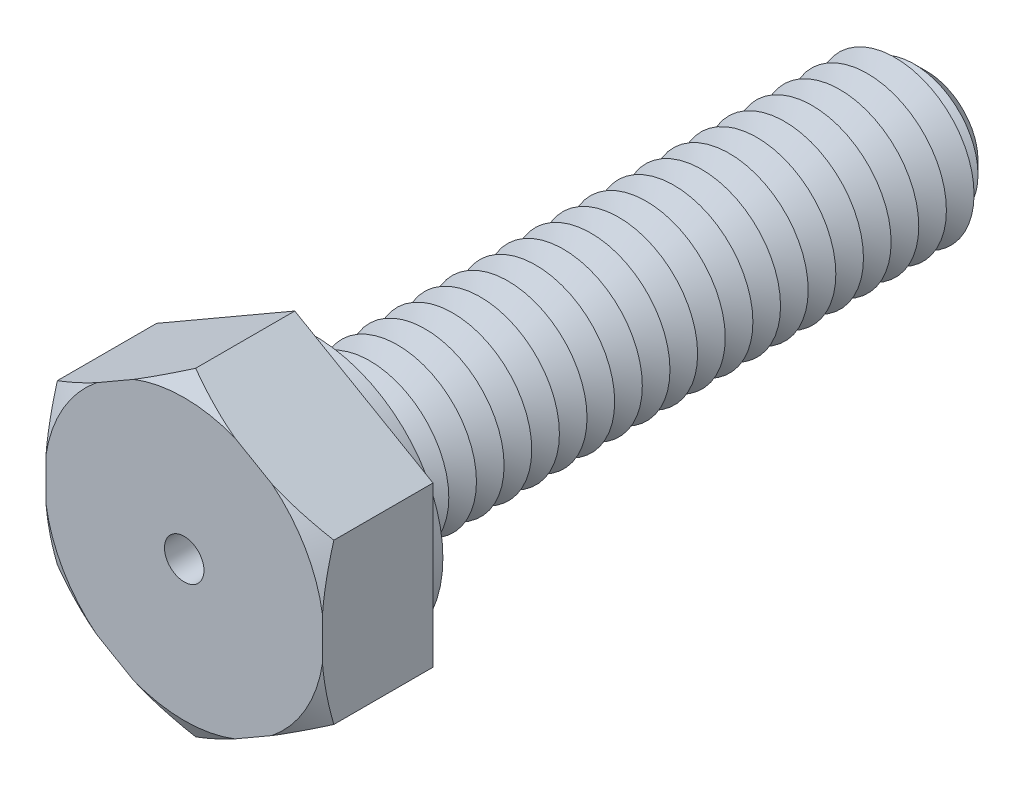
ISO-10303-21;
HEADER;
FILE_DESCRIPTION(('STEP AP214'),'2;1');
FILE_NAME('part.step','',(''),(''),'','','');
FILE_SCHEMA(('AUTOMOTIVE_DESIGN { 1 0 10303 214 1 1 1 1 }'));
ENDSEC;
DATA;
#1=APPLICATION_CONTEXT('core data for automotive mechanical design processes');
#2=APPLICATION_PROTOCOL_DEFINITION('international standard','automotive_design',2000,#1);
#3=PRODUCT_CONTEXT('',#1,'mechanical');
#4=PRODUCT('Part','Part','',(#3));
#5=PRODUCT_RELATED_PRODUCT_CATEGORY('part','',(#4));
#6=PRODUCT_DEFINITION_FORMATION('','',#4);
#7=PRODUCT_DEFINITION_CONTEXT('part definition',#1,'design');
#8=PRODUCT_DEFINITION('design','',#6,#7);
#9=PRODUCT_DEFINITION_SHAPE('','',#8);
#10=(LENGTH_UNIT() NAMED_UNIT(*) SI_UNIT(.MILLI.,.METRE.));
#11=(NAMED_UNIT(*) PLANE_ANGLE_UNIT() SI_UNIT($,.RADIAN.));
#12=(NAMED_UNIT(*) SI_UNIT($,.STERADIAN.) SOLID_ANGLE_UNIT());
#13=UNCERTAINTY_MEASURE_WITH_UNIT(LENGTH_MEASURE(1.E-05),#10,'distance_accuracy_value','');
#14=(GEOMETRIC_REPRESENTATION_CONTEXT(3) GLOBAL_UNCERTAINTY_ASSIGNED_CONTEXT((#13)) GLOBAL_UNIT_ASSIGNED_CONTEXT((#10,
#11,#12)) REPRESENTATION_CONTEXT('',''));
#15=CARTESIAN_POINT('',(0.,0.,0.));
#16=DIRECTION('',(0.,0.,1.));
#17=DIRECTION('',(1.,0.,0.));
#18=AXIS2_PLACEMENT_3D('',#15,#16,#17);
#19=CARTESIAN_POINT('',(3.5,2.02072594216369,2.8));
#20=DIRECTION('',(-0.5,-0.866025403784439,0.));
#21=DIRECTION('',(0.866025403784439,-0.5,0.));
#22=AXIS2_PLACEMENT_3D('',#19,#20,#21);
#23=PLANE('',#22);
#24=CARTESIAN_POINT('',(5.93124915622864,0.617043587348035,1.40176894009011));
#25=CARTESIAN_POINT('',(5.82127624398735,0.680536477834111,1.46111507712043));
#26=CARTESIAN_POINT('',(5.71104026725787,0.744181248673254,1.51982121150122));
#27=CARTESIAN_POINT('',(5.48993126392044,0.871838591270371,1.63565294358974));
#28=CARTESIAN_POINT('',(5.37905815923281,0.935851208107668,1.69277834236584));
#29=CARTESIAN_POINT('',(5.15623473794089,1.06449837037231,1.80531321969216));
#30=CARTESIAN_POINT('',(5.04428210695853,1.12913425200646,1.86071660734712));
#31=CARTESIAN_POINT('',(4.81953834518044,1.25889012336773,1.96920237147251));
#32=CARTESIAN_POINT('',(4.70674724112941,1.32401009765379,2.02228482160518));
#33=CARTESIAN_POINT('',(4.4773029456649,1.45647982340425,2.12693843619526));
#34=CARTESIAN_POINT('',(4.3606246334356,1.52384407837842,2.17843650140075));
#35=CARTESIAN_POINT('',(4.12610336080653,1.65924499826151,2.27776074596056));
#36=CARTESIAN_POINT('',(4.00826046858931,1.72728162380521,2.32558713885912));
#37=CARTESIAN_POINT('',(3.77136592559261,1.86405275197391,2.41666718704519));
#38=CARTESIAN_POINT('',(3.65231548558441,1.93278655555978,2.45992500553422));
#39=CARTESIAN_POINT('',(3.41281068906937,2.07106471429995,2.54086522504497));
#40=CARTESIAN_POINT('',(3.29235651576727,2.14060896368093,2.57854834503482));
#41=CARTESIAN_POINT('',(3.00433211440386,2.30689992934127,2.66006219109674));
#42=CARTESIAN_POINT('',(2.83610127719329,2.40402804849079,2.70086381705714));
#43=CARTESIAN_POINT('',(2.49725085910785,2.59966342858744,2.76622673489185));
#44=CARTESIAN_POINT('',(2.32663213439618,2.69817019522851,2.79079370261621));
#45=CARTESIAN_POINT('',(2.07079150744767,2.84587985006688,2.81342200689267));
#46=CARTESIAN_POINT('',(1.98601608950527,2.89482496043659,2.8186046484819));
#47=CARTESIAN_POINT('',(1.81634230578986,2.9927861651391,2.82423615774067));
#48=CARTESIAN_POINT('',(1.73144394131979,3.04180225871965,2.82468507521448));
#49=CARTESIAN_POINT('',(1.56172682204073,3.13978848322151,2.82082792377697));
#50=CARTESIAN_POINT('',(1.47690807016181,3.18875861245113,2.81652168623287));
#51=CARTESIAN_POINT('',(1.30753953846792,3.28654357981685,2.80328667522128));
#52=CARTESIAN_POINT('',(1.22298977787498,3.3353584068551,2.79435757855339));
#53=CARTESIAN_POINT('',(1.02330750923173,3.45064501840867,2.76803629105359));
#54=CARTESIAN_POINT('',(0.90836188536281,3.51700890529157,2.7487394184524));
#55=CARTESIAN_POINT('',(0.679569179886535,3.64910243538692,2.70286231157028));
#56=CARTESIAN_POINT('',(0.565722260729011,3.71483198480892,2.67628101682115));
#57=CARTESIAN_POINT('',(0.339141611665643,3.84564838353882,2.61683846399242));
#58=CARTESIAN_POINT('',(0.226409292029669,3.91073441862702,2.58397011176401));
#59=CARTESIAN_POINT('',(0.00220965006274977,4.04017614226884,2.512988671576));
#60=CARTESIAN_POINT('',(-0.109257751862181,4.10453187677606,2.47487591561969));
#61=CARTESIAN_POINT('',(-0.332327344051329,4.23332116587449,2.39383232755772));
#62=CARTESIAN_POINT('',(-0.443915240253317,4.29774646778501,2.35084938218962));
#63=CARTESIAN_POINT('',(-0.665905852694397,4.42591280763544,2.26126522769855));
#64=CARTESIAN_POINT('',(-0.776309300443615,4.48965426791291,2.2146664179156));
#65=CARTESIAN_POINT('',(-1.10600622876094,4.68000487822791,2.07044134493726));
#66=CARTESIAN_POINT('',(-1.32384189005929,4.80577235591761,1.96836549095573));
#67=CARTESIAN_POINT('',(-1.61545494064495,4.97413522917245,1.82536950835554));
#68=CARTESIAN_POINT('',(-1.69056073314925,5.01749757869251,1.78796601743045));
#69=CARTESIAN_POINT('',(-1.84044297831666,5.10403213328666,1.71229146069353));
#70=CARTESIAN_POINT('',(-1.91521944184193,5.14720434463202,1.67402042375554));
#71=CARTESIAN_POINT('',(-2.06368614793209,5.23292163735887,1.59712633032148));
#72=CARTESIAN_POINT('',(-2.13737951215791,5.27546852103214,1.55851128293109));
#73=CARTESIAN_POINT('',(-2.28450431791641,5.36041106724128,1.48061736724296));
#74=CARTESIAN_POINT('',(-2.35793575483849,5.40280672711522,1.44133848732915));
#75=CARTESIAN_POINT('',(-2.43124915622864,5.44513423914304,1.40176894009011));
#76=B_SPLINE_CURVE_WITH_KNOTS('',3,(#24,#25,#26,#27,#28,#29,#30,#31,#32,#33,#34,#35,#36,#37,#38,
#39,#40,#41,#42,#43,#44,#45,#46,#47,#48,#49,#50,#51,#52,#53,#54,#55,#56,#57,#58,#59,#60,#61,#62,
#63,#64,#65,#66,#67,#68,#69,#70,#71,#72,#73,#74,#75),.UNSPECIFIED.,.F.,.F.,(4,2,2,2,2,2,2,2,2,2,
2,2,2,2,2,2,2,2,2,2,2,2,2,2,2,4),(0.,0.420511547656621,0.841075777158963,1.26298883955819,
1.68488850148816,2.11755106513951,2.55018844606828,2.98242811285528,3.41461198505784,
4.0095520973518,4.60428410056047,4.89826759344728,5.19224799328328,5.48623881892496,
5.78025020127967,6.1823765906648,6.58456155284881,6.98720303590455,7.3898190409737,
7.7972442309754,8.20440134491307,9.01851321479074,9.30185450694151,9.58518638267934,
9.86552040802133,10.1458593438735),.UNSPECIFIED.);
#77=CARTESIAN_POINT('',(3.5,2.02072594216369,2.51132486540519));
#78=VERTEX_POINT('',#77);
#79=CARTESIAN_POINT('',(2.2178793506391,2.76095864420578,2.8));
#80=VERTEX_POINT('',#79);
#81=EDGE_CURVE('E132',#78,#80,#76,.T.);
#82=ORIENTED_EDGE('',*,*,#81,.F.);
#83=DIRECTION('',(0.,0.,-1.));
#84=VECTOR('',#83,1.);
#85=CARTESIAN_POINT('',(3.5,2.02072594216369,2.8));
#86=LINE('',#85,#84);
#87=CARTESIAN_POINT('',(3.5,2.02072594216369,0.));
#88=VERTEX_POINT('',#87);
#89=EDGE_CURVE('E144',#78,#88,#86,.T.);
#90=ORIENTED_EDGE('',*,*,#89,.T.);
#91=DIRECTION('',(-0.866025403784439,0.5,0.));
#92=VECTOR('',#91,1.);
#93=CARTESIAN_POINT('',(3.5,2.02072594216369,0.));
#94=LINE('',#93,#92);
#95=CARTESIAN_POINT('',(0.,4.04145188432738,0.));
#96=VERTEX_POINT('',#95);
#97=EDGE_CURVE('E378',#88,#96,#94,.T.);
#98=ORIENTED_EDGE('',*,*,#97,.T.);
#99=DIRECTION('',(0.,0.,-1.));
#100=VECTOR('',#99,1.);
#101=CARTESIAN_POINT('',(0.,4.04145188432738,2.8));
#102=LINE('',#101,#100);
#103=CARTESIAN_POINT('',(0.,4.04145188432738,2.51132486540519));
#104=VERTEX_POINT('',#103);
#105=EDGE_CURVE('E178',#104,#96,#102,.T.);
#106=ORIENTED_EDGE('',*,*,#105,.F.);
#107=CARTESIAN_POINT('',(1.2821206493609,3.30121918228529,2.8));
#108=VERTEX_POINT('',#107);
#109=EDGE_CURVE('E151',#108,#104,#76,.T.);
#110=ORIENTED_EDGE('',*,*,#109,.F.);
#111=DIRECTION('',(-0.866025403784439,0.5,0.));
#112=VECTOR('',#111,1.);
#113=CARTESIAN_POINT('',(3.5,2.02072594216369,2.8));
#114=LINE('',#113,#112);
#115=EDGE_CURVE('E148',#80,#108,#114,.T.);
#116=ORIENTED_EDGE('',*,*,#115,.F.);
#117=EDGE_LOOP('',(#82,#90,#98,#106,#110,#116));
#118=FACE_BOUND('',#117,.T.);
#119=ADVANCED_FACE('F39',(#118),#23,.F.);
#120=CARTESIAN_POINT('',(0.,4.04145188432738,2.8));
#121=DIRECTION('',(0.5,-0.866025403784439,0.));
#122=DIRECTION('',(0.866025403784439,0.5,0.));
#123=AXIS2_PLACEMENT_3D('',#120,#121,#122);
#124=PLANE('',#123);
#125=CARTESIAN_POINT('',(2.43124915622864,5.44513423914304,1.4017689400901));
#126=CARTESIAN_POINT('',(2.32127624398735,5.38164134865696,1.46111507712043));
#127=CARTESIAN_POINT('',(2.21104026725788,5.31799657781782,1.51982121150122));
#128=CARTESIAN_POINT('',(1.98993126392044,5.1903392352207,1.63565294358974));
#129=CARTESIAN_POINT('',(1.87905815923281,5.1263266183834,1.69277834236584));
#130=CARTESIAN_POINT('',(1.65623473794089,4.99767945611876,1.80531321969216));
#131=CARTESIAN_POINT('',(1.54428210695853,4.93304357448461,1.86071660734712));
#132=CARTESIAN_POINT('',(1.31953834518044,4.80328770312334,1.96920237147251));
#133=CARTESIAN_POINT('',(1.20674724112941,4.73816772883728,2.02228482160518));
#134=CARTESIAN_POINT('',(0.977302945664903,4.60569800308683,2.12693843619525));
#135=CARTESIAN_POINT('',(0.860624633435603,4.53833374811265,2.17843650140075));
#136=CARTESIAN_POINT('',(0.626103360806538,4.40293282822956,2.27776074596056));
#137=CARTESIAN_POINT('',(0.50826046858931,4.33489620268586,2.32558713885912));
#138=CARTESIAN_POINT('',(0.271365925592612,4.19812507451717,2.41666718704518));
#139=CARTESIAN_POINT('',(0.152315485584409,4.12939127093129,2.45992500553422));
#140=CARTESIAN_POINT('',(-0.0871893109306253,3.99111311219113,2.54086522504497));
#141=CARTESIAN_POINT('',(-0.207643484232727,3.92156886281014,2.57854834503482));
#142=CARTESIAN_POINT('',(-0.495667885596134,3.7552778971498,2.66006219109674));
#143=CARTESIAN_POINT('',(-0.663898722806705,3.65814977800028,2.70086381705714));
#144=CARTESIAN_POINT('',(-1.00274914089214,3.46251439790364,2.76622673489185));
#145=CARTESIAN_POINT('',(-1.17336786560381,3.36400763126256,2.79079370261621));
#146=CARTESIAN_POINT('',(-1.42920849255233,3.21629797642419,2.81342200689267));
#147=CARTESIAN_POINT('',(-1.51398391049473,3.16735286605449,2.8186046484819));
#148=CARTESIAN_POINT('',(-1.68365769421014,3.06939166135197,2.82423615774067));
#149=CARTESIAN_POINT('',(-1.7685560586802,3.02037556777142,2.82468507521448));
#150=CARTESIAN_POINT('',(-1.93827317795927,2.92238934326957,2.82082792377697));
#151=CARTESIAN_POINT('',(-2.02309192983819,2.87341921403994,2.81652168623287));
#152=CARTESIAN_POINT('',(-2.19246046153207,2.77563424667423,2.80328667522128));
#153=CARTESIAN_POINT('',(-2.27701022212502,2.72681941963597,2.79435757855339));
#154=CARTESIAN_POINT('',(-2.47669249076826,2.6115328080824,2.76803629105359));
#155=CARTESIAN_POINT('',(-2.59163811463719,2.54516892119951,2.7487394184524));
#156=CARTESIAN_POINT('',(-2.82043082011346,2.41307539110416,2.70286231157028));
#157=CARTESIAN_POINT('',(-2.93427773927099,2.34734584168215,2.67628101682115));
#158=CARTESIAN_POINT('',(-3.16085838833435,2.21652944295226,2.61683846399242));
#159=CARTESIAN_POINT('',(-3.27359070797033,2.15144340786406,2.58397011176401));
#160=CARTESIAN_POINT('',(-3.49779034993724,2.02200168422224,2.512988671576));
#161=CARTESIAN_POINT('',(-3.60925775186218,1.95764594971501,2.47487591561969));
#162=CARTESIAN_POINT('',(-3.83232734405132,1.82885666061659,2.39383232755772));
#163=CARTESIAN_POINT('',(-3.94391524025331,1.76443135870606,2.35084938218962));
#164=CARTESIAN_POINT('',(-4.16590585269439,1.63626501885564,2.26126522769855));
#165=CARTESIAN_POINT('',(-4.27630930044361,1.57252355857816,2.21466641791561));
#166=CARTESIAN_POINT('',(-4.60600622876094,1.38217294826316,2.07044134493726));
#167=CARTESIAN_POINT('',(-4.82384189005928,1.25640547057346,1.96836549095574));
#168=CARTESIAN_POINT('',(-5.11545494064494,1.08804259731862,1.82536950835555));
#169=CARTESIAN_POINT('',(-5.19056073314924,1.04468024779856,1.78796601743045));
#170=CARTESIAN_POINT('',(-5.34044297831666,0.958145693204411,1.71229146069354));
#171=CARTESIAN_POINT('',(-5.41521944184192,0.914973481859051,1.67402042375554));
#172=CARTESIAN_POINT('',(-5.56368614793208,0.829256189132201,1.59712633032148));
#173=CARTESIAN_POINT('',(-5.6373795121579,0.786709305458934,1.55851128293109));
#174=CARTESIAN_POINT('',(-5.78450431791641,0.701766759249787,1.48061736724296));
#175=CARTESIAN_POINT('',(-5.85793575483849,0.659371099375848,1.44133848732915));
#176=CARTESIAN_POINT('',(-5.93124915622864,0.617043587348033,1.40176894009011));
#177=B_SPLINE_CURVE_WITH_KNOTS('',3,(#125,#126,#127,#128,#129,#130,#131,#132,#133,#134,#135,
#136,#137,#138,#139,#140,#141,#142,#143,#144,#145,#146,#147,#148,#149,#150,#151,#152,#153,#154,
#155,#156,#157,#158,#159,#160,#161,#162,#163,#164,#165,#166,#167,#168,#169,#170,#171,#172,#173,
#174,#175,#176),.UNSPECIFIED.,.F.,.F.,(4,2,2,2,2,2,2,2,2,2,2,2,2,2,2,2,2,2,2,2,2,2,2,2,2,4),(0.,
0.420511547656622,0.841075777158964,1.26298883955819,1.68488850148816,2.11755106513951,
2.55018844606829,2.98242811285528,3.41461198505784,4.0095520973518,4.60428410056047,
4.89826759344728,5.19224799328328,5.48623881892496,5.78025020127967,6.1823765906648,
6.58456155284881,6.98720303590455,7.3898190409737,7.7972442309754,8.20440134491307,
9.01851321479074,9.30185450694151,9.58518638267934,9.86552040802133,10.1458593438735),.UNSPECIFIED.);
#178=CARTESIAN_POINT('',(-1.2821206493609,3.30121918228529,2.8));
#179=VERTEX_POINT('',#178);
#180=EDGE_CURVE('E1171',#104,#179,#177,.T.);
#181=ORIENTED_EDGE('',*,*,#180,.F.);
#182=ORIENTED_EDGE('',*,*,#105,.T.);
#183=DIRECTION('',(-0.866025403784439,-0.5,0.));
#184=VECTOR('',#183,1.);
#185=CARTESIAN_POINT('',(0.,4.04145188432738,0.));
#186=LINE('',#185,#184);
#187=CARTESIAN_POINT('',(-3.5,2.02072594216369,0.));
#188=VERTEX_POINT('',#187);
#189=EDGE_CURVE('E397',#96,#188,#186,.T.);
#190=ORIENTED_EDGE('',*,*,#189,.T.);
#191=DIRECTION('',(0.,0.,-1.));
#192=VECTOR('',#191,1.);
#193=CARTESIAN_POINT('',(-3.5,2.02072594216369,2.8));
#194=LINE('',#193,#192);
#195=CARTESIAN_POINT('',(-3.5,2.02072594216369,2.51132486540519));
#196=VERTEX_POINT('',#195);
#197=EDGE_CURVE('E175',#196,#188,#194,.T.);
#198=ORIENTED_EDGE('',*,*,#197,.F.);
#199=CARTESIAN_POINT('',(-2.2178793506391,2.76095864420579,2.8));
#200=VERTEX_POINT('',#199);
#201=EDGE_CURVE('E486',#200,#196,#177,.T.);
#202=ORIENTED_EDGE('',*,*,#201,.F.);
#203=DIRECTION('',(-0.866025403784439,-0.5,0.));
#204=VECTOR('',#203,1.);
#205=CARTESIAN_POINT('',(0.,4.04145188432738,2.8));
#206=LINE('',#205,#204);
#207=EDGE_CURVE('E381',#179,#200,#206,.T.);
#208=ORIENTED_EDGE('',*,*,#207,.F.);
#209=EDGE_LOOP('',(#181,#182,#190,#198,#202,#208));
#210=FACE_BOUND('',#209,.T.);
#211=ADVANCED_FACE('F494',(#210),#124,.F.);
#212=CARTESIAN_POINT('',(-3.5,2.02072594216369,2.8));
#213=DIRECTION('',(1.,0.,0.));
#214=DIRECTION('',(0.,1.,0.));
#215=AXIS2_PLACEMENT_3D('',#212,#213,#214);
#216=PLANE('',#215);
#217=CARTESIAN_POINT('',(-3.5,4.45197509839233,1.57509745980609));
#218=CARTESIAN_POINT('',(-3.5,4.32552348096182,1.632476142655));
#219=CARTESIAN_POINT('',(-3.5,4.19872625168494,1.68910722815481));
#220=CARTESIAN_POINT('',(-3.5,3.94429210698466,1.80051165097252));
#221=CARTESIAN_POINT('',(-3.5,3.81665504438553,1.85528465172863));
#222=CARTESIAN_POINT('',(-3.5,3.55990351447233,1.96281335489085));
#223=CARTESIAN_POINT('',(-3.5,3.43078510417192,2.01555968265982));
#224=CARTESIAN_POINT('',(-3.5,3.17145843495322,2.11829034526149));
#225=CARTESIAN_POINT('',(-3.5,3.04125022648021,2.16827480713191));
#226=CARTESIAN_POINT('',(-3.5,2.78016103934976,2.26465408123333));
#227=CARTESIAN_POINT('',(-3.5,2.64928566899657,2.31106393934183));
#228=CARTESIAN_POINT('',(-3.5,2.38615329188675,2.39977727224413));
#229=CARTESIAN_POINT('',(-3.5,2.25389619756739,2.44208048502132));
#230=CARTESIAN_POINT('',(-3.5,1.85519063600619,2.56138283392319));
#231=CARTESIAN_POINT('',(-3.5,1.58637912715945,2.63093897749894));
#232=CARTESIAN_POINT('',(-3.5,1.11975855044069,2.72563856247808));
#233=CARTESIAN_POINT('',(-3.5,0.923391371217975,2.75778053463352));
#234=CARTESIAN_POINT('',(-3.5,0.528527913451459,2.80406409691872));
#235=CARTESIAN_POINT('',(-3.5,0.330032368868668,2.81821170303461));
#236=CARTESIAN_POINT('',(-3.5,-0.0672968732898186,2.82680706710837));
#237=CARTESIAN_POINT('',(-3.5,-0.266130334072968,2.82126532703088));
#238=CARTESIAN_POINT('',(-3.5,-0.662321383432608,2.79120496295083));
#239=CARTESIAN_POINT('',(-3.5,-0.859678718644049,2.76668315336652));
#240=CARTESIAN_POINT('',(-3.5,-1.34971804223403,2.68500356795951));
#241=CARTESIAN_POINT('',(-3.5,-1.64068160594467,2.61765497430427));
#242=CARTESIAN_POINT('',(-3.5,-2.07181303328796,2.497569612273));
#243=CARTESIAN_POINT('',(-3.5,-2.21482517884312,2.45429352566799));
#244=CARTESIAN_POINT('',(-3.5,-2.49919378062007,2.36258423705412));
#245=CARTESIAN_POINT('',(-3.5,-2.64055035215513,2.31415139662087));
#246=CARTESIAN_POINT('',(-3.5,-2.92337235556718,2.2125676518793));
#247=CARTESIAN_POINT('',(-3.5,-3.06482042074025,2.15936898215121));
#248=CARTESIAN_POINT('',(-3.5,-3.34639535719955,2.04956763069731));
#249=CARTESIAN_POINT('',(-3.5,-3.48652214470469,1.99296473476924));
#250=CARTESIAN_POINT('',(-3.5,-3.76476497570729,1.87738368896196));
#251=CARTESIAN_POINT('',(-3.5,-3.90288810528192,1.81842250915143));
#252=CARTESIAN_POINT('',(-3.5,-4.1781332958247,1.6982956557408));
#253=CARTESIAN_POINT('',(-3.5,-4.31525559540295,1.6371305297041));
#254=CARTESIAN_POINT('',(-3.5,-4.45197509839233,1.57509745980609));
#255=B_SPLINE_CURVE_WITH_KNOTS('',3,(#217,#218,#219,#220,#221,#222,#223,#224,#225,#226,#227,
#228,#229,#230,#231,#232,#233,#234,#235,#236,#237,#238,#239,#240,#241,#242,#243,#244,#245,#246,
#247,#248,#249,#250,#251,#252,#253,#254),.UNSPECIFIED.,.F.,.F.,(4,2,2,2,2,2,2,2,2,2,2,2,2,2,2,2,
2,2,4),(0.,0.416588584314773,0.83325222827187,1.251655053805,1.67003861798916,2.08655215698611,
2.50309225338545,3.3347974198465,3.93106101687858,4.52712521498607,5.12287153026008,
5.71871785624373,6.61272902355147,7.06093271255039,7.50910499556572,7.9624204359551,
8.41576442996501,8.86628772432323,9.31669984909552),.UNSPECIFIED.);
#256=CARTESIAN_POINT('',(-3.5,0.540260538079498,2.8));
#257=VERTEX_POINT('',#256);
#258=EDGE_CURVE('E485',#196,#257,#255,.T.);
#259=ORIENTED_EDGE('',*,*,#258,.F.);
#260=ORIENTED_EDGE('',*,*,#197,.T.);
#261=DIRECTION('',(0.,-1.,0.));
#262=VECTOR('',#261,1.);
#263=CARTESIAN_POINT('',(-3.5,2.02072594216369,0.));
#264=LINE('',#263,#262);
#265=CARTESIAN_POINT('',(-3.5,-2.02072594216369,0.));
#266=VERTEX_POINT('',#265);
#267=EDGE_CURVE('E401',#188,#266,#264,.T.);
#268=ORIENTED_EDGE('',*,*,#267,.T.);
#269=DIRECTION('',(0.,0.,-1.));
#270=VECTOR('',#269,1.);
#271=CARTESIAN_POINT('',(-3.5,-2.02072594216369,2.8));
#272=LINE('',#271,#270);
#273=CARTESIAN_POINT('',(-3.5,-2.02072594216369,2.51132486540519));
#274=VERTEX_POINT('',#273);
#275=EDGE_CURVE('E173',#274,#266,#272,.T.);
#276=ORIENTED_EDGE('',*,*,#275,.F.);
#277=CARTESIAN_POINT('',(-3.5,-0.540260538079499,2.8));
#278=VERTEX_POINT('',#277);
#279=EDGE_CURVE('E479',#278,#274,#255,.T.);
#280=ORIENTED_EDGE('',*,*,#279,.F.);
#281=DIRECTION('',(0.,-1.,0.));
#282=VECTOR('',#281,1.);
#283=CARTESIAN_POINT('',(-3.5,2.02072594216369,2.8));
#284=LINE('',#283,#282);
#285=EDGE_CURVE('E385',#257,#278,#284,.T.);
#286=ORIENTED_EDGE('',*,*,#285,.F.);
#287=EDGE_LOOP('',(#259,#260,#268,#276,#280,#286));
#288=FACE_BOUND('',#287,.T.);
#289=ADVANCED_FACE('F491',(#288),#216,.F.);
#290=CARTESIAN_POINT('',(-3.5,-2.02072594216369,2.8));
#291=DIRECTION('',(0.5,0.866025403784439,0.));
#292=DIRECTION('',(-0.866025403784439,0.5,0.));
#293=AXIS2_PLACEMENT_3D('',#290,#291,#292);
#294=PLANE('',#293);
#295=CARTESIAN_POINT('',(-5.93124915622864,-0.617043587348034,1.4017689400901));
#296=CARTESIAN_POINT('',(-5.82127624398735,-0.68053647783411,1.46111507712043));
#297=CARTESIAN_POINT('',(-5.71104026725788,-0.744181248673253,1.51982121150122));
#298=CARTESIAN_POINT('',(-5.48993126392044,-0.87183859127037,1.63565294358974));
#299=CARTESIAN_POINT('',(-5.37905815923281,-0.935851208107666,1.69277834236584));
#300=CARTESIAN_POINT('',(-5.15623473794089,-1.06449837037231,1.80531321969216));
#301=CARTESIAN_POINT('',(-5.04428210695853,-1.12913425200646,1.86071660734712));
#302=CARTESIAN_POINT('',(-4.81953834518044,-1.25889012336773,1.96920237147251));
#303=CARTESIAN_POINT('',(-4.70674724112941,-1.32401009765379,2.02228482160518));
#304=CARTESIAN_POINT('',(-4.4773029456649,-1.45647982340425,2.12693843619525));
#305=CARTESIAN_POINT('',(-4.3606246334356,-1.52384407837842,2.17843650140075));
#306=CARTESIAN_POINT('',(-4.12610336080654,-1.65924499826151,2.27776074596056));
#307=CARTESIAN_POINT('',(-4.00826046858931,-1.72728162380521,2.32558713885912));
#308=CARTESIAN_POINT('',(-3.77136592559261,-1.8640527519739,2.41666718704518));
#309=CARTESIAN_POINT('',(-3.65231548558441,-1.93278655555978,2.45992500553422));
#310=CARTESIAN_POINT('',(-3.41281068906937,-2.07106471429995,2.54086522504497));
#311=CARTESIAN_POINT('',(-3.29235651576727,-2.14060896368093,2.57854834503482));
#312=CARTESIAN_POINT('',(-3.00433211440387,-2.30689992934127,2.66006219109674));
#313=CARTESIAN_POINT('',(-2.83610127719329,-2.40402804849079,2.70086381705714));
#314=CARTESIAN_POINT('',(-2.49725085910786,-2.59966342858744,2.76622673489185));
#315=CARTESIAN_POINT('',(-2.32663213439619,-2.69817019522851,2.79079370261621));
#316=CARTESIAN_POINT('',(-2.07079150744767,-2.84587985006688,2.81342200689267));
#317=CARTESIAN_POINT('',(-1.98601608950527,-2.89482496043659,2.8186046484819));
#318=CARTESIAN_POINT('',(-1.81634230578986,-2.9927861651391,2.82423615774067));
#319=CARTESIAN_POINT('',(-1.7314439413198,-3.04180225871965,2.82468507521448));
#320=CARTESIAN_POINT('',(-1.56172682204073,-3.13978848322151,2.82082792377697));
#321=CARTESIAN_POINT('',(-1.47690807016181,-3.18875861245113,2.81652168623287));
#322=CARTESIAN_POINT('',(-1.30753953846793,-3.28654357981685,2.80328667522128));
#323=CARTESIAN_POINT('',(-1.22298977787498,-3.3353584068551,2.79435757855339));
#324=CARTESIAN_POINT('',(-1.02330750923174,-3.45064501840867,2.76803629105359));
#325=CARTESIAN_POINT('',(-0.908361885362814,-3.51700890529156,2.7487394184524));
#326=CARTESIAN_POINT('',(-0.679569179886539,-3.64910243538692,2.70286231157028));
#327=CARTESIAN_POINT('',(-0.565722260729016,-3.71483198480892,2.67628101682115));
#328=CARTESIAN_POINT('',(-0.339141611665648,-3.84564838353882,2.61683846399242));
#329=CARTESIAN_POINT('',(-0.226409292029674,-3.91073441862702,2.58397011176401));
#330=CARTESIAN_POINT('',(-0.00220965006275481,-4.04017614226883,2.512988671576));
#331=CARTESIAN_POINT('',(0.109257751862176,-4.10453187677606,2.47487591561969));
#332=CARTESIAN_POINT('',(0.332327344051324,-4.23332116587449,2.39383232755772));
#333=CARTESIAN_POINT('',(0.443915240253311,-4.29774646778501,2.35084938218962));
#334=CARTESIAN_POINT('',(0.665905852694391,-4.42591280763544,2.26126522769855));
#335=CARTESIAN_POINT('',(0.776309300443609,-4.48965426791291,2.2146664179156));
#336=CARTESIAN_POINT('',(1.10600622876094,-4.68000487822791,2.07044134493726));
#337=CARTESIAN_POINT('',(1.32384189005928,-4.80577235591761,1.96836549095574));
#338=CARTESIAN_POINT('',(1.61545494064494,-4.97413522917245,1.82536950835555));
#339=CARTESIAN_POINT('',(1.69056073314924,-5.01749757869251,1.78796601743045));
#340=CARTESIAN_POINT('',(1.84044297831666,-5.10403213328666,1.71229146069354));
#341=CARTESIAN_POINT('',(1.91521944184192,-5.14720434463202,1.67402042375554));
#342=CARTESIAN_POINT('',(2.06368614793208,-5.23292163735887,1.59712633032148));
#343=CARTESIAN_POINT('',(2.1373795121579,-5.27546852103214,1.55851128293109));
#344=CARTESIAN_POINT('',(2.28450431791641,-5.36041106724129,1.48061736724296));
#345=CARTESIAN_POINT('',(2.35793575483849,-5.40280672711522,1.44133848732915));
#346=CARTESIAN_POINT('',(2.43124915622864,-5.44513423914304,1.40176894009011));
#347=B_SPLINE_CURVE_WITH_KNOTS('',3,(#295,#296,#297,#298,#299,#300,#301,#302,#303,#304,#305,
#306,#307,#308,#309,#310,#311,#312,#313,#314,#315,#316,#317,#318,#319,#320,#321,#322,#323,#324,
#325,#326,#327,#328,#329,#330,#331,#332,#333,#334,#335,#336,#337,#338,#339,#340,#341,#342,#343,
#344,#345,#346),.UNSPECIFIED.,.F.,.F.,(4,2,2,2,2,2,2,2,2,2,2,2,2,2,2,2,2,2,2,2,2,2,2,2,2,4),(0.,
0.420511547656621,0.841075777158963,1.26298883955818,1.68488850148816,2.11755106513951,
2.55018844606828,2.98242811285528,3.41461198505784,4.00955209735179,4.60428410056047,
4.89826759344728,5.19224799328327,5.48623881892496,5.78025020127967,6.1823765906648,
6.58456155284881,6.98720303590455,7.38981904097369,7.7972442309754,8.20440134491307,
9.01851321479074,9.30185450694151,9.58518638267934,9.86552040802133,10.1458593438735),.UNSPECIFIED.);
#348=CARTESIAN_POINT('',(-2.2178793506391,-2.76095864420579,2.8));
#349=VERTEX_POINT('',#348);
#350=EDGE_CURVE('E417',#274,#349,#347,.T.);
#351=ORIENTED_EDGE('',*,*,#350,.F.);
#352=ORIENTED_EDGE('',*,*,#275,.T.);
#353=DIRECTION('',(0.866025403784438,-0.5,0.));
#354=VECTOR('',#353,1.);
#355=CARTESIAN_POINT('',(-3.5,-2.02072594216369,0.));
#356=LINE('',#355,#354);
#357=CARTESIAN_POINT('',(0.,-4.04145188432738,0.));
#358=VERTEX_POINT('',#357);
#359=EDGE_CURVE('E405',#266,#358,#356,.T.);
#360=ORIENTED_EDGE('',*,*,#359,.T.);
#361=DIRECTION('',(0.,0.,-1.));
#362=VECTOR('',#361,1.);
#363=CARTESIAN_POINT('',(0.,-4.04145188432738,2.8));
#364=LINE('',#363,#362);
#365=CARTESIAN_POINT('',(0.,-4.04145188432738,2.51132486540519));
#366=VERTEX_POINT('',#365);
#367=EDGE_CURVE('E163',#366,#358,#364,.T.);
#368=ORIENTED_EDGE('',*,*,#367,.F.);
#369=CARTESIAN_POINT('',(-1.2821206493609,-3.30121918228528,2.8));
#370=VERTEX_POINT('',#369);
#371=EDGE_CURVE('E415',#370,#366,#347,.T.);
#372=ORIENTED_EDGE('',*,*,#371,.F.);
#373=DIRECTION('',(0.866025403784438,-0.5,0.));
#374=VECTOR('',#373,1.);
#375=CARTESIAN_POINT('',(-3.5,-2.02072594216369,2.8));
#376=LINE('',#375,#374);
#377=EDGE_CURVE('E389',#349,#370,#376,.T.);
#378=ORIENTED_EDGE('',*,*,#377,.F.);
#379=EDGE_LOOP('',(#351,#352,#360,#368,#372,#378));
#380=FACE_BOUND('',#379,.T.);
#381=ADVANCED_FACE('F434',(#380),#294,.F.);
#382=CARTESIAN_POINT('',(0.,-4.04145188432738,2.8));
#383=DIRECTION('',(-0.5,0.866025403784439,0.));
#384=DIRECTION('',(-0.866025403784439,-0.5,0.));
#385=AXIS2_PLACEMENT_3D('',#382,#383,#384);
#386=PLANE('',#385);
#387=CARTESIAN_POINT('',(-2.43124915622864,-5.44513423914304,1.4017689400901));
#388=CARTESIAN_POINT('',(-2.32127624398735,-5.38164134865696,1.46111507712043));
#389=CARTESIAN_POINT('',(-2.21104026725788,-5.31799657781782,1.51982121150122));
#390=CARTESIAN_POINT('',(-1.98993126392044,-5.1903392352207,1.63565294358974));
#391=CARTESIAN_POINT('',(-1.87905815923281,-5.1263266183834,1.69277834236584));
#392=CARTESIAN_POINT('',(-1.65623473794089,-4.99767945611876,1.80531321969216));
#393=CARTESIAN_POINT('',(-1.54428210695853,-4.93304357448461,1.86071660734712));
#394=CARTESIAN_POINT('',(-1.31953834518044,-4.80328770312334,1.96920237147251));
#395=CARTESIAN_POINT('',(-1.20674724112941,-4.73816772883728,2.02228482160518));
#396=CARTESIAN_POINT('',(-0.977302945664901,-4.60569800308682,2.12693843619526));
#397=CARTESIAN_POINT('',(-0.860624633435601,-4.53833374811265,2.17843650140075));
#398=CARTESIAN_POINT('',(-0.626103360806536,-4.40293282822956,2.27776074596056));
#399=CARTESIAN_POINT('',(-0.508260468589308,-4.33489620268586,2.32558713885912));
#400=CARTESIAN_POINT('',(-0.27136592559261,-4.19812507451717,2.41666718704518));
#401=CARTESIAN_POINT('',(-0.152315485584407,-4.12939127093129,2.45992500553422));
#402=CARTESIAN_POINT('',(0.0871893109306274,-3.99111311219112,2.54086522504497));
#403=CARTESIAN_POINT('',(0.20764348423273,-3.92156886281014,2.57854834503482));
#404=CARTESIAN_POINT('',(0.495667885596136,-3.7552778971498,2.66006219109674));
#405=CARTESIAN_POINT('',(0.663898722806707,-3.65814977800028,2.70086381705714));
#406=CARTESIAN_POINT('',(1.00274914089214,-3.46251439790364,2.76622673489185));
#407=CARTESIAN_POINT('',(1.17336786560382,-3.36400763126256,2.79079370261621));
#408=CARTESIAN_POINT('',(1.42920849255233,-3.21629797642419,2.81342200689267));
#409=CARTESIAN_POINT('',(1.51398391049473,-3.16735286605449,2.8186046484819));
#410=CARTESIAN_POINT('',(1.68365769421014,-3.06939166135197,2.82423615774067));
#411=CARTESIAN_POINT('',(1.76855605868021,-3.02037556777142,2.82468507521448));
#412=CARTESIAN_POINT('',(1.93827317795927,-2.92238934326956,2.82082792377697));
#413=CARTESIAN_POINT('',(2.02309192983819,-2.87341921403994,2.81652168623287));
#414=CARTESIAN_POINT('',(2.19246046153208,-2.77563424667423,2.80328667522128));
#415=CARTESIAN_POINT('',(2.27701022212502,-2.72681941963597,2.79435757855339));
#416=CARTESIAN_POINT('',(2.47669249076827,-2.6115328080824,2.76803629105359));
#417=CARTESIAN_POINT('',(2.59163811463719,-2.54516892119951,2.7487394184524));
#418=CARTESIAN_POINT('',(2.82043082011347,-2.41307539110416,2.70286231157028));
#419=CARTESIAN_POINT('',(2.93427773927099,-2.34734584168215,2.67628101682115));
#420=CARTESIAN_POINT('',(3.16085838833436,-2.21652944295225,2.61683846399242));
#421=CARTESIAN_POINT('',(3.27359070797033,-2.15144340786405,2.58397011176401));
#422=CARTESIAN_POINT('',(3.49779034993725,-2.02200168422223,2.512988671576));
#423=CARTESIAN_POINT('',(3.60925775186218,-1.95764594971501,2.47487591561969));
#424=CARTESIAN_POINT('',(3.83232734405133,-1.82885666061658,2.39383232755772));
#425=CARTESIAN_POINT('',(3.94391524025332,-1.76443135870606,2.35084938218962));
#426=CARTESIAN_POINT('',(4.1659058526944,-1.63626501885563,2.26126522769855));
#427=CARTESIAN_POINT('',(4.27630930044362,-1.57252355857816,2.2146664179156));
#428=CARTESIAN_POINT('',(4.60600622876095,-1.38217294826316,2.07044134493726));
#429=CARTESIAN_POINT('',(4.82384189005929,-1.25640547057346,1.96836549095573));
#430=CARTESIAN_POINT('',(5.11545494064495,-1.08804259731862,1.82536950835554));
#431=CARTESIAN_POINT('',(5.19056073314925,-1.04468024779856,1.78796601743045));
#432=CARTESIAN_POINT('',(5.34044297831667,-0.95814569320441,1.71229146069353));
#433=CARTESIAN_POINT('',(5.41521944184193,-0.914973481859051,1.67402042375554));
#434=CARTESIAN_POINT('',(5.56368614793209,-0.829256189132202,1.59712633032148));
#435=CARTESIAN_POINT('',(5.63737951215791,-0.786709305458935,1.55851128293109));
#436=CARTESIAN_POINT('',(5.78450431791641,-0.70176675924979,1.48061736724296));
#437=CARTESIAN_POINT('',(5.85793575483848,-0.659371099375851,1.44133848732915));
#438=CARTESIAN_POINT('',(5.93124915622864,-0.617043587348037,1.40176894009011));
#439=B_SPLINE_CURVE_WITH_KNOTS('',3,(#387,#388,#389,#390,#391,#392,#393,#394,#395,#396,#397,
#398,#399,#400,#401,#402,#403,#404,#405,#406,#407,#408,#409,#410,#411,#412,#413,#414,#415,#416,
#417,#418,#419,#420,#421,#422,#423,#424,#425,#426,#427,#428,#429,#430,#431,#432,#433,#434,#435,
#436,#437,#438),.UNSPECIFIED.,.F.,.F.,(4,2,2,2,2,2,2,2,2,2,2,2,2,2,2,2,2,2,2,2,2,2,2,2,2,4),(0.,
0.420511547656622,0.841075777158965,1.26298883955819,1.68488850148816,2.11755106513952,
2.55018844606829,2.98242811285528,3.41461198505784,4.0095520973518,4.60428410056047,
4.89826759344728,5.19224799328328,5.48623881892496,5.78025020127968,6.18237659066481,
6.58456155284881,6.98720303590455,7.3898190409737,7.79724423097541,8.20440134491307,
9.01851321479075,9.30185450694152,9.58518638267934,9.86552040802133,10.1458593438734),.UNSPECIFIED.);
#440=CARTESIAN_POINT('',(1.2821206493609,-3.30121918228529,2.8));
#441=VERTEX_POINT('',#440);
#442=EDGE_CURVE('E64',#366,#441,#439,.T.);
#443=ORIENTED_EDGE('',*,*,#442,.F.);
#444=ORIENTED_EDGE('',*,*,#367,.T.);
#445=DIRECTION('',(0.866025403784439,0.5,0.));
#446=VECTOR('',#445,1.);
#447=CARTESIAN_POINT('',(0.,-4.04145188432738,0.));
#448=LINE('',#447,#446);
#449=CARTESIAN_POINT('',(3.5,-2.02072594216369,0.));
#450=VERTEX_POINT('',#449);
#451=EDGE_CURVE('E408',#358,#450,#448,.T.);
#452=ORIENTED_EDGE('',*,*,#451,.T.);
#453=DIRECTION('',(0.,0.,-1.));
#454=VECTOR('',#453,1.);
#455=CARTESIAN_POINT('',(3.5,-2.02072594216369,2.8));
#456=LINE('',#455,#454);
#457=CARTESIAN_POINT('',(3.5,-2.02072594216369,2.51132486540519));
#458=VERTEX_POINT('',#457);
#459=EDGE_CURVE('E157',#458,#450,#456,.T.);
#460=ORIENTED_EDGE('',*,*,#459,.F.);
#461=CARTESIAN_POINT('',(2.2178793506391,-2.76095864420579,2.8));
#462=VERTEX_POINT('',#461);
#463=EDGE_CURVE('E442',#462,#458,#439,.T.);
#464=ORIENTED_EDGE('',*,*,#463,.F.);
#465=DIRECTION('',(0.866025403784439,0.5,0.));
#466=VECTOR('',#465,1.);
#467=CARTESIAN_POINT('',(0.,-4.04145188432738,2.8));
#468=LINE('',#467,#466);
#469=EDGE_CURVE('E166',#441,#462,#468,.T.);
#470=ORIENTED_EDGE('',*,*,#469,.F.);
#471=EDGE_LOOP('',(#443,#444,#452,#460,#464,#470));
#472=FACE_BOUND('',#471,.T.);
#473=ADVANCED_FACE('F439',(#472),#386,.F.);
#474=CARTESIAN_POINT('',(3.5,-2.02072594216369,2.8));
#475=DIRECTION('',(-1.,0.,0.));
#476=DIRECTION('',(0.,-1.,0.));
#477=AXIS2_PLACEMENT_3D('',#474,#475,#476);
#478=PLANE('',#477);
#479=CARTESIAN_POINT('',(3.5,-4.45197509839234,1.57509745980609));
#480=CARTESIAN_POINT('',(3.5,-4.32552348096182,1.632476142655));
#481=CARTESIAN_POINT('',(3.5,-4.19872625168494,1.68910722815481));
#482=CARTESIAN_POINT('',(3.5,-3.94429210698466,1.80051165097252));
#483=CARTESIAN_POINT('',(3.5,-3.81665504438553,1.85528465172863));
#484=CARTESIAN_POINT('',(3.5,-3.55990351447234,1.96281335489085));
#485=CARTESIAN_POINT('',(3.5,-3.43078510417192,2.01555968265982));
#486=CARTESIAN_POINT('',(3.5,-3.17145843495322,2.11829034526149));
#487=CARTESIAN_POINT('',(3.5,-3.04125022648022,2.16827480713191));
#488=CARTESIAN_POINT('',(3.5,-2.78016103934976,2.26465408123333));
#489=CARTESIAN_POINT('',(3.5,-2.64928566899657,2.31106393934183));
#490=CARTESIAN_POINT('',(3.5,-2.38615329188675,2.39977727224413));
#491=CARTESIAN_POINT('',(3.5,-2.25389619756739,2.44208048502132));
#492=CARTESIAN_POINT('',(3.5,-1.85519063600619,2.56138283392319));
#493=CARTESIAN_POINT('',(3.5,-1.58637912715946,2.63093897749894));
#494=CARTESIAN_POINT('',(3.5,-1.11975855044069,2.72563856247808));
#495=CARTESIAN_POINT('',(3.5,-0.923391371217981,2.75778053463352));
#496=CARTESIAN_POINT('',(3.5,-0.528527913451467,2.80406409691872));
#497=CARTESIAN_POINT('',(3.5,-0.330032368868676,2.81821170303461));
#498=CARTESIAN_POINT('',(3.5,0.0672968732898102,2.82680706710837));
#499=CARTESIAN_POINT('',(3.5,0.26613033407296,2.82126532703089));
#500=CARTESIAN_POINT('',(3.5,0.662321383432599,2.79120496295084));
#501=CARTESIAN_POINT('',(3.5,0.85967871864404,2.76668315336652));
#502=CARTESIAN_POINT('',(3.5,1.34971804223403,2.68500356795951));
#503=CARTESIAN_POINT('',(3.5,1.64068160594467,2.61765497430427));
#504=CARTESIAN_POINT('',(3.5,2.07181303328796,2.497569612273));
#505=CARTESIAN_POINT('',(3.5,2.21482517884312,2.45429352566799));
#506=CARTESIAN_POINT('',(3.5,2.49919378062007,2.36258423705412));
#507=CARTESIAN_POINT('',(3.5,2.64055035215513,2.31415139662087));
#508=CARTESIAN_POINT('',(3.5,2.92337235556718,2.2125676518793));
#509=CARTESIAN_POINT('',(3.5,3.06482042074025,2.15936898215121));
#510=CARTESIAN_POINT('',(3.5,3.34639535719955,2.04956763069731));
#511=CARTESIAN_POINT('',(3.5,3.48652214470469,1.99296473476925));
#512=CARTESIAN_POINT('',(3.5,3.76476497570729,1.87738368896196));
#513=CARTESIAN_POINT('',(3.5,3.90288810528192,1.81842250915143));
#514=CARTESIAN_POINT('',(3.5,4.1781332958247,1.6982956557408));
#515=CARTESIAN_POINT('',(3.5,4.31525559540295,1.6371305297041));
#516=CARTESIAN_POINT('',(3.5,4.45197509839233,1.57509745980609));
#517=B_SPLINE_CURVE_WITH_KNOTS('',3,(#479,#480,#481,#482,#483,#484,#485,#486,#487,#488,#489,
#490,#491,#492,#493,#494,#495,#496,#497,#498,#499,#500,#501,#502,#503,#504,#505,#506,#507,#508,
#509,#510,#511,#512,#513,#514,#515,#516),.UNSPECIFIED.,.F.,.F.,(4,2,2,2,2,2,2,2,2,2,2,2,2,2,2,2,
2,2,4),(0.,0.416588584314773,0.83325222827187,1.251655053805,1.67003861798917,2.08655215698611,
2.50309225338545,3.33479741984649,3.93106101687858,4.52712521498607,5.12287153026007,
5.71871785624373,6.61272902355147,7.0609327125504,7.50910499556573,7.96242043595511,
8.41576442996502,8.86628772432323,9.31669984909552),.UNSPECIFIED.);
#518=CARTESIAN_POINT('',(3.5,-0.540260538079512,2.8));
#519=VERTEX_POINT('',#518);
#520=EDGE_CURVE('E56',#458,#519,#517,.T.);
#521=ORIENTED_EDGE('',*,*,#520,.F.);
#522=ORIENTED_EDGE('',*,*,#459,.T.);
#523=DIRECTION('',(0.,1.,0.));
#524=VECTOR('',#523,1.);
#525=CARTESIAN_POINT('',(3.5,-2.02072594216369,0.));
#526=LINE('',#525,#524);
#527=EDGE_CURVE('E154',#450,#88,#526,.T.);
#528=ORIENTED_EDGE('',*,*,#527,.T.);
#529=ORIENTED_EDGE('',*,*,#89,.F.);
#530=CARTESIAN_POINT('',(3.5,0.540260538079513,2.8));
#531=VERTEX_POINT('',#530);
#532=EDGE_CURVE('E129',#531,#78,#517,.T.);
#533=ORIENTED_EDGE('',*,*,#532,.F.);
#534=DIRECTION('',(0.,1.,0.));
#535=VECTOR('',#534,1.);
#536=CARTESIAN_POINT('',(3.5,-2.02072594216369,2.8));
#537=LINE('',#536,#535);
#538=EDGE_CURVE('E158',#519,#531,#537,.T.);
#539=ORIENTED_EDGE('',*,*,#538,.F.);
#540=EDGE_LOOP('',(#521,#522,#528,#529,#533,#539));
#541=FACE_BOUND('',#540,.T.);
#542=ADVANCED_FACE('F152',(#541),#478,.F.);
#543=CARTESIAN_POINT('',(0.,0.,2.8));
#544=DIRECTION('',(0.,0.,1.));
#545=DIRECTION('',(1.,0.,0.));
#546=AXIS2_PLACEMENT_3D('',#543,#544,#545);
#547=PLANE('',#546);
#548=CARTESIAN_POINT('',(0.,0.,2.8));
#549=DIRECTION('',(0.,0.,1.));
#550=DIRECTION('',(1.,0.,0.));
#551=AXIS2_PLACEMENT_3D('',#548,#549,#550);
#552=CIRCLE('',#551,0.5);
#553=CARTESIAN_POINT('',(0.5,0.,2.8));
#554=VERTEX_POINT('',#553);
#555=EDGE_CURVE('E1152',#554,#554,#552,.T.);
#556=ORIENTED_EDGE('',*,*,#555,.F.);
#557=EDGE_LOOP('',(#556));
#558=FACE_BOUND('',#557,.T.);
#559=ORIENTED_EDGE('',*,*,#538,.T.);
#560=CARTESIAN_POINT('',(0.,0.,2.8));
#561=DIRECTION('',(0.,0.,1.));
#562=DIRECTION('',(1.,0.,0.));
#563=AXIS2_PLACEMENT_3D('',#560,#561,#562);
#564=CIRCLE('',#563,3.54145188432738);
#565=EDGE_CURVE('E134',#531,#80,#564,.T.);
#566=ORIENTED_EDGE('',*,*,#565,.T.);
#567=ORIENTED_EDGE('',*,*,#115,.T.);
#568=CARTESIAN_POINT('',(0.,0.,2.8));
#569=DIRECTION('',(0.,0.,1.));
#570=DIRECTION('',(1.,0.,0.));
#571=AXIS2_PLACEMENT_3D('',#568,#569,#570);
#572=CIRCLE('',#571,3.54145188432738);
#573=EDGE_CURVE('E11',#108,#179,#572,.T.);
#574=ORIENTED_EDGE('',*,*,#573,.T.);
#575=ORIENTED_EDGE('',*,*,#207,.T.);
#576=EDGE_CURVE('E49',#200,#257,#572,.T.);
#577=ORIENTED_EDGE('',*,*,#576,.T.);
#578=ORIENTED_EDGE('',*,*,#285,.T.);
#579=EDGE_CURVE('E420',#278,#349,#572,.T.);
#580=ORIENTED_EDGE('',*,*,#579,.T.);
#581=ORIENTED_EDGE('',*,*,#377,.T.);
#582=EDGE_CURVE('E419',#370,#441,#572,.T.);
#583=ORIENTED_EDGE('',*,*,#582,.T.);
#584=ORIENTED_EDGE('',*,*,#469,.T.);
#585=EDGE_CURVE('E43',#462,#519,#572,.T.);
#586=ORIENTED_EDGE('',*,*,#585,.T.);
#587=EDGE_LOOP('',(#559,#566,#567,#574,#575,#577,#578,#580,#581,#583,#584,#586));
#588=FACE_BOUND('',#587,.T.);
#589=ADVANCED_FACE('F428',(#558,#588),#547,.T.);
#590=CARTESIAN_POINT('',(0.,0.,0.));
#591=DIRECTION('',(0.,0.,1.));
#592=DIRECTION('',(1.,0.,0.));
#593=AXIS2_PLACEMENT_3D('',#590,#591,#592);
#594=PLANE('',#593);
#595=CARTESIAN_POINT('',(0.,0.,0.));
#596=DIRECTION('',(0.,0.,1.));
#597=DIRECTION('',(1.,0.,0.));
#598=AXIS2_PLACEMENT_3D('',#595,#596,#597);
#599=CIRCLE('',#598,3.25);
#600=CARTESIAN_POINT('',(3.25,0.,0.));
#601=VERTEX_POINT('',#600);
#602=EDGE_CURVE('E181',#601,#601,#599,.F.);
#603=ORIENTED_EDGE('',*,*,#602,.F.);
#604=EDGE_LOOP('',(#603));
#605=FACE_BOUND('',#604,.T.);
#606=ORIENTED_EDGE('',*,*,#97,.F.);
#607=ORIENTED_EDGE('',*,*,#527,.F.);
#608=ORIENTED_EDGE('',*,*,#451,.F.);
#609=ORIENTED_EDGE('',*,*,#359,.F.);
#610=ORIENTED_EDGE('',*,*,#267,.F.);
#611=ORIENTED_EDGE('',*,*,#189,.F.);
#612=EDGE_LOOP('',(#606,#607,#608,#609,#610,#611));
#613=FACE_BOUND('',#612,.T.);
#614=ADVANCED_FACE('F527',(#605,#613),#594,.F.);
#615=CARTESIAN_POINT('',(0.,0.,-0.5));
#616=DIRECTION('',(0.,0.,1.));
#617=DIRECTION('',(1.,0.,0.));
#618=AXIS2_PLACEMENT_3D('',#615,#616,#617);
#619=CYLINDRICAL_SURFACE('',#618,3.25);
#620=CARTESIAN_POINT('',(0.,0.,-0.5));
#621=DIRECTION('',(0.,0.,-1.));
#622=DIRECTION('',(-1.,0.,0.));
#623=AXIS2_PLACEMENT_3D('',#620,#621,#622);
#624=CIRCLE('',#623,3.25);
#625=CARTESIAN_POINT('',(-3.25,0.,-0.5));
#626=VERTEX_POINT('',#625);
#627=EDGE_CURVE('E374',#626,#626,#624,.T.);
#628=ORIENTED_EDGE('',*,*,#627,.F.);
#629=EDGE_LOOP('',(#628));
#630=FACE_BOUND('',#629,.T.);
#631=ORIENTED_EDGE('',*,*,#602,.T.);
#632=EDGE_LOOP('',(#631));
#633=FACE_BOUND('',#632,.T.);
#634=ADVANCED_FACE('F534',(#630,#633),#619,.T.);
#635=CARTESIAN_POINT('',(0.,0.,-0.5));
#636=DIRECTION('',(0.,0.,-1.));
#637=DIRECTION('',(-1.,0.,0.));
#638=AXIS2_PLACEMENT_3D('',#635,#636,#637);
#639=PLANE('',#638);
#640=CARTESIAN_POINT('',(0.,0.,-0.5));
#641=DIRECTION('',(0.,0.,1.));
#642=DIRECTION('',(1.,0.,0.));
#643=AXIS2_PLACEMENT_3D('',#640,#641,#642);
#644=CIRCLE('',#643,2.);
#645=CARTESIAN_POINT('',(2.,0.,-0.5));
#646=VERTEX_POINT('',#645);
#647=EDGE_CURVE('E370',#646,#646,#644,.T.);
#648=ORIENTED_EDGE('',*,*,#647,.T.);
#649=EDGE_LOOP('',(#648));
#650=FACE_BOUND('',#649,.T.);
#651=ORIENTED_EDGE('',*,*,#627,.T.);
#652=EDGE_LOOP('',(#651));
#653=FACE_BOUND('',#652,.T.);
#654=ADVANCED_FACE('F541',(#650,#653),#639,.T.);
#655=CARTESIAN_POINT('',(0.,0.,-0.5));
#656=DIRECTION('',(0.,0.,1.));
#657=DIRECTION('',(1.,0.,0.));
#658=AXIS2_PLACEMENT_3D('',#655,#656,#657);
#659=CONICAL_SURFACE('',#658,2.,1.0471975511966);
#660=CARTESIAN_POINT('',(0.,0.,-0.850000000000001));
#661=DIRECTION('',(0.,0.,1.));
#662=DIRECTION('',(1.,0.,0.));
#663=AXIS2_PLACEMENT_3D('',#660,#661,#662);
#664=CIRCLE('',#663,1.39378221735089);
#665=CARTESIAN_POINT('',(1.39378221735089,0.,-0.850000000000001));
#666=VERTEX_POINT('',#665);
#667=EDGE_CURVE('E366',#666,#666,#664,.T.);
#668=ORIENTED_EDGE('',*,*,#667,.T.);
#669=EDGE_LOOP('',(#668));
#670=FACE_BOUND('',#669,.T.);
#671=ORIENTED_EDGE('',*,*,#647,.F.);
#672=EDGE_LOOP('',(#671));
#673=FACE_BOUND('',#672,.T.);
#674=ADVANCED_FACE('F548',(#670,#673),#659,.T.);
#675=CARTESIAN_POINT('',(0.,0.,-0.850000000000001));
#676=DIRECTION('',(0.,0.,-1.));
#677=DIRECTION('',(-1.,0.,0.));
#678=AXIS2_PLACEMENT_3D('',#675,#676,#677);
#679=CONICAL_SURFACE('',#678,1.39378221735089,1.0471975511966);
#680=CARTESIAN_POINT('',(0.,0.,-1.2));
#681=DIRECTION('',(0.,0.,1.));
#682=DIRECTION('',(1.,0.,0.));
#683=AXIS2_PLACEMENT_3D('',#680,#681,#682);
#684=CIRCLE('',#683,2.);
#685=CARTESIAN_POINT('',(2.,0.,-1.2));
#686=VERTEX_POINT('',#685);
#687=EDGE_CURVE('E362',#686,#686,#684,.T.);
#688=ORIENTED_EDGE('',*,*,#687,.T.);
#689=EDGE_LOOP('',(#688));
#690=FACE_BOUND('',#689,.T.);
#691=ORIENTED_EDGE('',*,*,#667,.F.);
#692=EDGE_LOOP('',(#691));
#693=FACE_BOUND('',#692,.T.);
#694=ADVANCED_FACE('F555',(#690,#693),#679,.T.);
#695=CARTESIAN_POINT('',(0.,0.,-1.2));
#696=DIRECTION('',(0.,0.,1.));
#697=DIRECTION('',(1.,0.,0.));
#698=AXIS2_PLACEMENT_3D('',#695,#696,#697);
#699=CONICAL_SURFACE('',#698,2.,1.0471975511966);
#700=CARTESIAN_POINT('',(0.,0.,-1.55));
#701=DIRECTION('',(0.,0.,1.));
#702=DIRECTION('',(1.,0.,0.));
#703=AXIS2_PLACEMENT_3D('',#700,#701,#702);
#704=CIRCLE('',#703,1.39378221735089);
#705=CARTESIAN_POINT('',(1.39378221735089,0.,-1.55));
#706=VERTEX_POINT('',#705);
#707=EDGE_CURVE('E358',#706,#706,#704,.T.);
#708=ORIENTED_EDGE('',*,*,#707,.T.);
#709=EDGE_LOOP('',(#708));
#710=FACE_BOUND('',#709,.T.);
#711=ORIENTED_EDGE('',*,*,#687,.F.);
#712=EDGE_LOOP('',(#711));
#713=FACE_BOUND('',#712,.T.);
#714=ADVANCED_FACE('F562',(#710,#713),#699,.T.);
#715=CARTESIAN_POINT('',(0.,0.,-1.55));
#716=DIRECTION('',(0.,0.,-1.));
#717=DIRECTION('',(-1.,0.,0.));
#718=AXIS2_PLACEMENT_3D('',#715,#716,#717);
#719=CONICAL_SURFACE('',#718,1.39378221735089,1.0471975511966);
#720=CARTESIAN_POINT('',(0.,0.,-1.9));
#721=DIRECTION('',(0.,0.,1.));
#722=DIRECTION('',(1.,0.,0.));
#723=AXIS2_PLACEMENT_3D('',#720,#721,#722);
#724=CIRCLE('',#723,2.);
#725=CARTESIAN_POINT('',(2.,0.,-1.9));
#726=VERTEX_POINT('',#725);
#727=EDGE_CURVE('E354',#726,#726,#724,.T.);
#728=ORIENTED_EDGE('',*,*,#727,.T.);
#729=EDGE_LOOP('',(#728));
#730=FACE_BOUND('',#729,.T.);
#731=ORIENTED_EDGE('',*,*,#707,.F.);
#732=EDGE_LOOP('',(#731));
#733=FACE_BOUND('',#732,.T.);
#734=ADVANCED_FACE('F569',(#730,#733),#719,.T.);
#735=CARTESIAN_POINT('',(0.,0.,-1.9));
#736=DIRECTION('',(0.,0.,1.));
#737=DIRECTION('',(1.,0.,0.));
#738=AXIS2_PLACEMENT_3D('',#735,#736,#737);
#739=CONICAL_SURFACE('',#738,2.,1.0471975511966);
#740=CARTESIAN_POINT('',(0.,0.,-2.25));
#741=DIRECTION('',(0.,0.,1.));
#742=DIRECTION('',(1.,0.,0.));
#743=AXIS2_PLACEMENT_3D('',#740,#741,#742);
#744=CIRCLE('',#743,1.39378221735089);
#745=CARTESIAN_POINT('',(1.39378221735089,0.,-2.25));
#746=VERTEX_POINT('',#745);
#747=EDGE_CURVE('E350',#746,#746,#744,.T.);
#748=ORIENTED_EDGE('',*,*,#747,.T.);
#749=EDGE_LOOP('',(#748));
#750=FACE_BOUND('',#749,.T.);
#751=ORIENTED_EDGE('',*,*,#727,.F.);
#752=EDGE_LOOP('',(#751));
#753=FACE_BOUND('',#752,.T.);
#754=ADVANCED_FACE('F576',(#750,#753),#739,.T.);
#755=CARTESIAN_POINT('',(0.,0.,-2.25));
#756=DIRECTION('',(0.,0.,-1.));
#757=DIRECTION('',(-1.,0.,0.));
#758=AXIS2_PLACEMENT_3D('',#755,#756,#757);
#759=CONICAL_SURFACE('',#758,1.39378221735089,1.0471975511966);
#760=CARTESIAN_POINT('',(0.,0.,-2.6));
#761=DIRECTION('',(0.,0.,1.));
#762=DIRECTION('',(1.,0.,0.));
#763=AXIS2_PLACEMENT_3D('',#760,#761,#762);
#764=CIRCLE('',#763,2.);
#765=CARTESIAN_POINT('',(2.,0.,-2.6));
#766=VERTEX_POINT('',#765);
#767=EDGE_CURVE('E346',#766,#766,#764,.T.);
#768=ORIENTED_EDGE('',*,*,#767,.T.);
#769=EDGE_LOOP('',(#768));
#770=FACE_BOUND('',#769,.T.);
#771=ORIENTED_EDGE('',*,*,#747,.F.);
#772=EDGE_LOOP('',(#771));
#773=FACE_BOUND('',#772,.T.);
#774=ADVANCED_FACE('F583',(#770,#773),#759,.T.);
#775=CARTESIAN_POINT('',(0.,0.,-2.6));
#776=DIRECTION('',(0.,0.,1.));
#777=DIRECTION('',(1.,0.,0.));
#778=AXIS2_PLACEMENT_3D('',#775,#776,#777);
#779=CONICAL_SURFACE('',#778,2.,1.0471975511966);
#780=CARTESIAN_POINT('',(0.,0.,-2.95));
#781=DIRECTION('',(0.,0.,1.));
#782=DIRECTION('',(1.,0.,0.));
#783=AXIS2_PLACEMENT_3D('',#780,#781,#782);
#784=CIRCLE('',#783,1.39378221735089);
#785=CARTESIAN_POINT('',(1.39378221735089,0.,-2.95));
#786=VERTEX_POINT('',#785);
#787=EDGE_CURVE('E342',#786,#786,#784,.T.);
#788=ORIENTED_EDGE('',*,*,#787,.T.);
#789=EDGE_LOOP('',(#788));
#790=FACE_BOUND('',#789,.T.);
#791=ORIENTED_EDGE('',*,*,#767,.F.);
#792=EDGE_LOOP('',(#791));
#793=FACE_BOUND('',#792,.T.);
#794=ADVANCED_FACE('F590',(#790,#793),#779,.T.);
#795=CARTESIAN_POINT('',(0.,0.,-2.95));
#796=DIRECTION('',(0.,0.,-1.));
#797=DIRECTION('',(-1.,0.,0.));
#798=AXIS2_PLACEMENT_3D('',#795,#796,#797);
#799=CONICAL_SURFACE('',#798,1.39378221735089,1.0471975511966);
#800=CARTESIAN_POINT('',(0.,0.,-3.3));
#801=DIRECTION('',(0.,0.,1.));
#802=DIRECTION('',(1.,0.,0.));
#803=AXIS2_PLACEMENT_3D('',#800,#801,#802);
#804=CIRCLE('',#803,2.);
#805=CARTESIAN_POINT('',(2.,0.,-3.3));
#806=VERTEX_POINT('',#805);
#807=EDGE_CURVE('E338',#806,#806,#804,.T.);
#808=ORIENTED_EDGE('',*,*,#807,.T.);
#809=EDGE_LOOP('',(#808));
#810=FACE_BOUND('',#809,.T.);
#811=ORIENTED_EDGE('',*,*,#787,.F.);
#812=EDGE_LOOP('',(#811));
#813=FACE_BOUND('',#812,.T.);
#814=ADVANCED_FACE('F597',(#810,#813),#799,.T.);
#815=CARTESIAN_POINT('',(0.,0.,-3.3));
#816=DIRECTION('',(0.,0.,1.));
#817=DIRECTION('',(1.,0.,0.));
#818=AXIS2_PLACEMENT_3D('',#815,#816,#817);
#819=CONICAL_SURFACE('',#818,2.,1.0471975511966);
#820=CARTESIAN_POINT('',(0.,0.,-3.65));
#821=DIRECTION('',(0.,0.,1.));
#822=DIRECTION('',(1.,0.,0.));
#823=AXIS2_PLACEMENT_3D('',#820,#821,#822);
#824=CIRCLE('',#823,1.39378221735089);
#825=CARTESIAN_POINT('',(1.39378221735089,0.,-3.65));
#826=VERTEX_POINT('',#825);
#827=EDGE_CURVE('E334',#826,#826,#824,.T.);
#828=ORIENTED_EDGE('',*,*,#827,.T.);
#829=EDGE_LOOP('',(#828));
#830=FACE_BOUND('',#829,.T.);
#831=ORIENTED_EDGE('',*,*,#807,.F.);
#832=EDGE_LOOP('',(#831));
#833=FACE_BOUND('',#832,.T.);
#834=ADVANCED_FACE('F604',(#830,#833),#819,.T.);
#835=CARTESIAN_POINT('',(0.,0.,-3.65));
#836=DIRECTION('',(0.,0.,-1.));
#837=DIRECTION('',(-1.,0.,0.));
#838=AXIS2_PLACEMENT_3D('',#835,#836,#837);
#839=CONICAL_SURFACE('',#838,1.39378221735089,1.0471975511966);
#840=CARTESIAN_POINT('',(0.,0.,-4.));
#841=DIRECTION('',(0.,0.,1.));
#842=DIRECTION('',(1.,0.,0.));
#843=AXIS2_PLACEMENT_3D('',#840,#841,#842);
#844=CIRCLE('',#843,2.);
#845=CARTESIAN_POINT('',(2.,0.,-4.));
#846=VERTEX_POINT('',#845);
#847=EDGE_CURVE('E330',#846,#846,#844,.T.);
#848=ORIENTED_EDGE('',*,*,#847,.T.);
#849=EDGE_LOOP('',(#848));
#850=FACE_BOUND('',#849,.T.);
#851=ORIENTED_EDGE('',*,*,#827,.F.);
#852=EDGE_LOOP('',(#851));
#853=FACE_BOUND('',#852,.T.);
#854=ADVANCED_FACE('F611',(#850,#853),#839,.T.);
#855=CARTESIAN_POINT('',(0.,0.,-4.));
#856=DIRECTION('',(0.,0.,1.));
#857=DIRECTION('',(1.,0.,0.));
#858=AXIS2_PLACEMENT_3D('',#855,#856,#857);
#859=CONICAL_SURFACE('',#858,2.,1.0471975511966);
#860=CARTESIAN_POINT('',(0.,0.,-4.35));
#861=DIRECTION('',(0.,0.,1.));
#862=DIRECTION('',(1.,0.,0.));
#863=AXIS2_PLACEMENT_3D('',#860,#861,#862);
#864=CIRCLE('',#863,1.39378221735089);
#865=CARTESIAN_POINT('',(1.39378221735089,0.,-4.35));
#866=VERTEX_POINT('',#865);
#867=EDGE_CURVE('E326',#866,#866,#864,.T.);
#868=ORIENTED_EDGE('',*,*,#867,.T.);
#869=EDGE_LOOP('',(#868));
#870=FACE_BOUND('',#869,.T.);
#871=ORIENTED_EDGE('',*,*,#847,.F.);
#872=EDGE_LOOP('',(#871));
#873=FACE_BOUND('',#872,.T.);
#874=ADVANCED_FACE('F618',(#870,#873),#859,.T.);
#875=CARTESIAN_POINT('',(0.,0.,-4.35));
#876=DIRECTION('',(0.,0.,-1.));
#877=DIRECTION('',(-1.,0.,0.));
#878=AXIS2_PLACEMENT_3D('',#875,#876,#877);
#879=CONICAL_SURFACE('',#878,1.39378221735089,1.0471975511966);
#880=CARTESIAN_POINT('',(0.,0.,-4.7));
#881=DIRECTION('',(0.,0.,1.));
#882=DIRECTION('',(1.,0.,0.));
#883=AXIS2_PLACEMENT_3D('',#880,#881,#882);
#884=CIRCLE('',#883,2.);
#885=CARTESIAN_POINT('',(2.,0.,-4.7));
#886=VERTEX_POINT('',#885);
#887=EDGE_CURVE('E322',#886,#886,#884,.T.);
#888=ORIENTED_EDGE('',*,*,#887,.T.);
#889=EDGE_LOOP('',(#888));
#890=FACE_BOUND('',#889,.T.);
#891=ORIENTED_EDGE('',*,*,#867,.F.);
#892=EDGE_LOOP('',(#891));
#893=FACE_BOUND('',#892,.T.);
#894=ADVANCED_FACE('F625',(#890,#893),#879,.T.);
#895=CARTESIAN_POINT('',(0.,0.,-4.7));
#896=DIRECTION('',(0.,0.,1.));
#897=DIRECTION('',(1.,0.,0.));
#898=AXIS2_PLACEMENT_3D('',#895,#896,#897);
#899=CONICAL_SURFACE('',#898,2.,1.0471975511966);
#900=CARTESIAN_POINT('',(0.,0.,-5.05));
#901=DIRECTION('',(0.,0.,1.));
#902=DIRECTION('',(1.,0.,0.));
#903=AXIS2_PLACEMENT_3D('',#900,#901,#902);
#904=CIRCLE('',#903,1.39378221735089);
#905=CARTESIAN_POINT('',(1.39378221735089,0.,-5.05));
#906=VERTEX_POINT('',#905);
#907=EDGE_CURVE('E318',#906,#906,#904,.T.);
#908=ORIENTED_EDGE('',*,*,#907,.T.);
#909=EDGE_LOOP('',(#908));
#910=FACE_BOUND('',#909,.T.);
#911=ORIENTED_EDGE('',*,*,#887,.F.);
#912=EDGE_LOOP('',(#911));
#913=FACE_BOUND('',#912,.T.);
#914=ADVANCED_FACE('F632',(#910,#913),#899,.T.);
#915=CARTESIAN_POINT('',(0.,0.,-5.05));
#916=DIRECTION('',(0.,0.,-1.));
#917=DIRECTION('',(-1.,0.,0.));
#918=AXIS2_PLACEMENT_3D('',#915,#916,#917);
#919=CONICAL_SURFACE('',#918,1.39378221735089,1.0471975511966);
#920=CARTESIAN_POINT('',(0.,0.,-5.4));
#921=DIRECTION('',(0.,0.,1.));
#922=DIRECTION('',(1.,0.,0.));
#923=AXIS2_PLACEMENT_3D('',#920,#921,#922);
#924=CIRCLE('',#923,2.);
#925=CARTESIAN_POINT('',(2.,0.,-5.4));
#926=VERTEX_POINT('',#925);
#927=EDGE_CURVE('E314',#926,#926,#924,.T.);
#928=ORIENTED_EDGE('',*,*,#927,.T.);
#929=EDGE_LOOP('',(#928));
#930=FACE_BOUND('',#929,.T.);
#931=ORIENTED_EDGE('',*,*,#907,.F.);
#932=EDGE_LOOP('',(#931));
#933=FACE_BOUND('',#932,.T.);
#934=ADVANCED_FACE('F639',(#930,#933),#919,.T.);
#935=CARTESIAN_POINT('',(0.,0.,-5.4));
#936=DIRECTION('',(0.,0.,1.));
#937=DIRECTION('',(1.,0.,0.));
#938=AXIS2_PLACEMENT_3D('',#935,#936,#937);
#939=CONICAL_SURFACE('',#938,2.,1.0471975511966);
#940=CARTESIAN_POINT('',(0.,0.,-5.75));
#941=DIRECTION('',(0.,0.,1.));
#942=DIRECTION('',(1.,0.,0.));
#943=AXIS2_PLACEMENT_3D('',#940,#941,#942);
#944=CIRCLE('',#943,1.39378221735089);
#945=CARTESIAN_POINT('',(1.39378221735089,0.,-5.75));
#946=VERTEX_POINT('',#945);
#947=EDGE_CURVE('E310',#946,#946,#944,.T.);
#948=ORIENTED_EDGE('',*,*,#947,.T.);
#949=EDGE_LOOP('',(#948));
#950=FACE_BOUND('',#949,.T.);
#951=ORIENTED_EDGE('',*,*,#927,.F.);
#952=EDGE_LOOP('',(#951));
#953=FACE_BOUND('',#952,.T.);
#954=ADVANCED_FACE('F646',(#950,#953),#939,.T.);
#955=CARTESIAN_POINT('',(0.,0.,-5.75));
#956=DIRECTION('',(0.,0.,-1.));
#957=DIRECTION('',(-1.,0.,0.));
#958=AXIS2_PLACEMENT_3D('',#955,#956,#957);
#959=CONICAL_SURFACE('',#958,1.39378221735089,1.0471975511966);
#960=CARTESIAN_POINT('',(0.,0.,-6.1));
#961=DIRECTION('',(0.,0.,1.));
#962=DIRECTION('',(1.,0.,0.));
#963=AXIS2_PLACEMENT_3D('',#960,#961,#962);
#964=CIRCLE('',#963,2.);
#965=CARTESIAN_POINT('',(2.,0.,-6.1));
#966=VERTEX_POINT('',#965);
#967=EDGE_CURVE('E306',#966,#966,#964,.T.);
#968=ORIENTED_EDGE('',*,*,#967,.T.);
#969=EDGE_LOOP('',(#968));
#970=FACE_BOUND('',#969,.T.);
#971=ORIENTED_EDGE('',*,*,#947,.F.);
#972=EDGE_LOOP('',(#971));
#973=FACE_BOUND('',#972,.T.);
#974=ADVANCED_FACE('F653',(#970,#973),#959,.T.);
#975=CARTESIAN_POINT('',(0.,0.,-6.1));
#976=DIRECTION('',(0.,0.,1.));
#977=DIRECTION('',(1.,0.,0.));
#978=AXIS2_PLACEMENT_3D('',#975,#976,#977);
#979=CONICAL_SURFACE('',#978,2.,1.0471975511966);
#980=CARTESIAN_POINT('',(0.,0.,-6.45));
#981=DIRECTION('',(0.,0.,1.));
#982=DIRECTION('',(1.,0.,0.));
#983=AXIS2_PLACEMENT_3D('',#980,#981,#982);
#984=CIRCLE('',#983,1.39378221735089);
#985=CARTESIAN_POINT('',(1.39378221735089,0.,-6.45));
#986=VERTEX_POINT('',#985);
#987=EDGE_CURVE('E302',#986,#986,#984,.T.);
#988=ORIENTED_EDGE('',*,*,#987,.T.);
#989=EDGE_LOOP('',(#988));
#990=FACE_BOUND('',#989,.T.);
#991=ORIENTED_EDGE('',*,*,#967,.F.);
#992=EDGE_LOOP('',(#991));
#993=FACE_BOUND('',#992,.T.);
#994=ADVANCED_FACE('F660',(#990,#993),#979,.T.);
#995=CARTESIAN_POINT('',(0.,0.,-6.45));
#996=DIRECTION('',(0.,0.,-1.));
#997=DIRECTION('',(-1.,0.,0.));
#998=AXIS2_PLACEMENT_3D('',#995,#996,#997);
#999=CONICAL_SURFACE('',#998,1.39378221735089,1.0471975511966);
#1000=CARTESIAN_POINT('',(0.,0.,-6.8));
#1001=DIRECTION('',(0.,0.,1.));
#1002=DIRECTION('',(1.,0.,0.));
#1003=AXIS2_PLACEMENT_3D('',#1000,#1001,#1002);
#1004=CIRCLE('',#1003,2.);
#1005=CARTESIAN_POINT('',(2.,0.,-6.8));
#1006=VERTEX_POINT('',#1005);
#1007=EDGE_CURVE('E298',#1006,#1006,#1004,.T.);
#1008=ORIENTED_EDGE('',*,*,#1007,.T.);
#1009=EDGE_LOOP('',(#1008));
#1010=FACE_BOUND('',#1009,.T.);
#1011=ORIENTED_EDGE('',*,*,#987,.F.);
#1012=EDGE_LOOP('',(#1011));
#1013=FACE_BOUND('',#1012,.T.);
#1014=ADVANCED_FACE('F667',(#1010,#1013),#999,.T.);
#1015=CARTESIAN_POINT('',(0.,0.,-6.8));
#1016=DIRECTION('',(0.,0.,1.));
#1017=DIRECTION('',(1.,0.,0.));
#1018=AXIS2_PLACEMENT_3D('',#1015,#1016,#1017);
#1019=CONICAL_SURFACE('',#1018,2.,1.0471975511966);
#1020=CARTESIAN_POINT('',(0.,0.,-7.15));
#1021=DIRECTION('',(0.,0.,1.));
#1022=DIRECTION('',(1.,0.,0.));
#1023=AXIS2_PLACEMENT_3D('',#1020,#1021,#1022);
#1024=CIRCLE('',#1023,1.39378221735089);
#1025=CARTESIAN_POINT('',(1.39378221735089,0.,-7.15));
#1026=VERTEX_POINT('',#1025);
#1027=EDGE_CURVE('E294',#1026,#1026,#1024,.T.);
#1028=ORIENTED_EDGE('',*,*,#1027,.T.);
#1029=EDGE_LOOP('',(#1028));
#1030=FACE_BOUND('',#1029,.T.);
#1031=ORIENTED_EDGE('',*,*,#1007,.F.);
#1032=EDGE_LOOP('',(#1031));
#1033=FACE_BOUND('',#1032,.T.);
#1034=ADVANCED_FACE('F674',(#1030,#1033),#1019,.T.);
#1035=CARTESIAN_POINT('',(0.,0.,-7.15));
#1036=DIRECTION('',(0.,0.,-1.));
#1037=DIRECTION('',(-1.,0.,0.));
#1038=AXIS2_PLACEMENT_3D('',#1035,#1036,#1037);
#1039=CONICAL_SURFACE('',#1038,1.39378221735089,1.0471975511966);
#1040=CARTESIAN_POINT('',(0.,0.,-7.5));
#1041=DIRECTION('',(0.,0.,1.));
#1042=DIRECTION('',(1.,0.,0.));
#1043=AXIS2_PLACEMENT_3D('',#1040,#1041,#1042);
#1044=CIRCLE('',#1043,2.);
#1045=CARTESIAN_POINT('',(2.,0.,-7.5));
#1046=VERTEX_POINT('',#1045);
#1047=EDGE_CURVE('E290',#1046,#1046,#1044,.T.);
#1048=ORIENTED_EDGE('',*,*,#1047,.T.);
#1049=EDGE_LOOP('',(#1048));
#1050=FACE_BOUND('',#1049,.T.);
#1051=ORIENTED_EDGE('',*,*,#1027,.F.);
#1052=EDGE_LOOP('',(#1051));
#1053=FACE_BOUND('',#1052,.T.);
#1054=ADVANCED_FACE('F681',(#1050,#1053),#1039,.T.);
#1055=CARTESIAN_POINT('',(0.,0.,-7.5));
#1056=DIRECTION('',(0.,0.,1.));
#1057=DIRECTION('',(1.,0.,0.));
#1058=AXIS2_PLACEMENT_3D('',#1055,#1056,#1057);
#1059=CONICAL_SURFACE('',#1058,2.,1.0471975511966);
#1060=CARTESIAN_POINT('',(0.,0.,-7.85));
#1061=DIRECTION('',(0.,0.,1.));
#1062=DIRECTION('',(1.,0.,0.));
#1063=AXIS2_PLACEMENT_3D('',#1060,#1061,#1062);
#1064=CIRCLE('',#1063,1.39378221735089);
#1065=CARTESIAN_POINT('',(1.39378221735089,0.,-7.85));
#1066=VERTEX_POINT('',#1065);
#1067=EDGE_CURVE('E286',#1066,#1066,#1064,.T.);
#1068=ORIENTED_EDGE('',*,*,#1067,.T.);
#1069=EDGE_LOOP('',(#1068));
#1070=FACE_BOUND('',#1069,.T.);
#1071=ORIENTED_EDGE('',*,*,#1047,.F.);
#1072=EDGE_LOOP('',(#1071));
#1073=FACE_BOUND('',#1072,.T.);
#1074=ADVANCED_FACE('F688',(#1070,#1073),#1059,.T.);
#1075=CARTESIAN_POINT('',(0.,0.,-7.85));
#1076=DIRECTION('',(0.,0.,-1.));
#1077=DIRECTION('',(-1.,0.,0.));
#1078=AXIS2_PLACEMENT_3D('',#1075,#1076,#1077);
#1079=CONICAL_SURFACE('',#1078,1.39378221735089,1.0471975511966);
#1080=CARTESIAN_POINT('',(0.,0.,-8.2));
#1081=DIRECTION('',(0.,0.,1.));
#1082=DIRECTION('',(1.,0.,0.));
#1083=AXIS2_PLACEMENT_3D('',#1080,#1081,#1082);
#1084=CIRCLE('',#1083,2.);
#1085=CARTESIAN_POINT('',(2.,0.,-8.2));
#1086=VERTEX_POINT('',#1085);
#1087=EDGE_CURVE('E282',#1086,#1086,#1084,.T.);
#1088=ORIENTED_EDGE('',*,*,#1087,.T.);
#1089=EDGE_LOOP('',(#1088));
#1090=FACE_BOUND('',#1089,.T.);
#1091=ORIENTED_EDGE('',*,*,#1067,.F.);
#1092=EDGE_LOOP('',(#1091));
#1093=FACE_BOUND('',#1092,.T.);
#1094=ADVANCED_FACE('F695',(#1090,#1093),#1079,.T.);
#1095=CARTESIAN_POINT('',(0.,0.,-8.2));
#1096=DIRECTION('',(0.,0.,1.));
#1097=DIRECTION('',(1.,0.,0.));
#1098=AXIS2_PLACEMENT_3D('',#1095,#1096,#1097);
#1099=CONICAL_SURFACE('',#1098,2.,1.0471975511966);
#1100=CARTESIAN_POINT('',(0.,0.,-8.55));
#1101=DIRECTION('',(0.,0.,1.));
#1102=DIRECTION('',(1.,0.,0.));
#1103=AXIS2_PLACEMENT_3D('',#1100,#1101,#1102);
#1104=CIRCLE('',#1103,1.39378221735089);
#1105=CARTESIAN_POINT('',(1.39378221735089,0.,-8.55));
#1106=VERTEX_POINT('',#1105);
#1107=EDGE_CURVE('E278',#1106,#1106,#1104,.T.);
#1108=ORIENTED_EDGE('',*,*,#1107,.T.);
#1109=EDGE_LOOP('',(#1108));
#1110=FACE_BOUND('',#1109,.T.);
#1111=ORIENTED_EDGE('',*,*,#1087,.F.);
#1112=EDGE_LOOP('',(#1111));
#1113=FACE_BOUND('',#1112,.T.);
#1114=ADVANCED_FACE('F702',(#1110,#1113),#1099,.T.);
#1115=CARTESIAN_POINT('',(0.,0.,-8.55));
#1116=DIRECTION('',(0.,0.,-1.));
#1117=DIRECTION('',(-1.,0.,0.));
#1118=AXIS2_PLACEMENT_3D('',#1115,#1116,#1117);
#1119=CONICAL_SURFACE('',#1118,1.39378221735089,1.0471975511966);
#1120=CARTESIAN_POINT('',(0.,0.,-8.9));
#1121=DIRECTION('',(0.,0.,1.));
#1122=DIRECTION('',(1.,0.,0.));
#1123=AXIS2_PLACEMENT_3D('',#1120,#1121,#1122);
#1124=CIRCLE('',#1123,2.);
#1125=CARTESIAN_POINT('',(2.,0.,-8.9));
#1126=VERTEX_POINT('',#1125);
#1127=EDGE_CURVE('E274',#1126,#1126,#1124,.T.);
#1128=ORIENTED_EDGE('',*,*,#1127,.T.);
#1129=EDGE_LOOP('',(#1128));
#1130=FACE_BOUND('',#1129,.T.);
#1131=ORIENTED_EDGE('',*,*,#1107,.F.);
#1132=EDGE_LOOP('',(#1131));
#1133=FACE_BOUND('',#1132,.T.);
#1134=ADVANCED_FACE('F709',(#1130,#1133),#1119,.T.);
#1135=CARTESIAN_POINT('',(0.,0.,-8.9));
#1136=DIRECTION('',(0.,0.,1.));
#1137=DIRECTION('',(1.,0.,0.));
#1138=AXIS2_PLACEMENT_3D('',#1135,#1136,#1137);
#1139=CONICAL_SURFACE('',#1138,2.,1.0471975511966);
#1140=CARTESIAN_POINT('',(0.,0.,-9.25));
#1141=DIRECTION('',(0.,0.,1.));
#1142=DIRECTION('',(1.,0.,0.));
#1143=AXIS2_PLACEMENT_3D('',#1140,#1141,#1142);
#1144=CIRCLE('',#1143,1.39378221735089);
#1145=CARTESIAN_POINT('',(1.39378221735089,0.,-9.25));
#1146=VERTEX_POINT('',#1145);
#1147=EDGE_CURVE('E270',#1146,#1146,#1144,.T.);
#1148=ORIENTED_EDGE('',*,*,#1147,.T.);
#1149=EDGE_LOOP('',(#1148));
#1150=FACE_BOUND('',#1149,.T.);
#1151=ORIENTED_EDGE('',*,*,#1127,.F.);
#1152=EDGE_LOOP('',(#1151));
#1153=FACE_BOUND('',#1152,.T.);
#1154=ADVANCED_FACE('F716',(#1150,#1153),#1139,.T.);
#1155=CARTESIAN_POINT('',(0.,0.,-9.25));
#1156=DIRECTION('',(0.,0.,-1.));
#1157=DIRECTION('',(-1.,0.,0.));
#1158=AXIS2_PLACEMENT_3D('',#1155,#1156,#1157);
#1159=CONICAL_SURFACE('',#1158,1.39378221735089,1.0471975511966);
#1160=CARTESIAN_POINT('',(0.,0.,-9.6));
#1161=DIRECTION('',(0.,0.,1.));
#1162=DIRECTION('',(1.,0.,0.));
#1163=AXIS2_PLACEMENT_3D('',#1160,#1161,#1162);
#1164=CIRCLE('',#1163,2.);
#1165=CARTESIAN_POINT('',(2.,0.,-9.6));
#1166=VERTEX_POINT('',#1165);
#1167=EDGE_CURVE('E266',#1166,#1166,#1164,.T.);
#1168=ORIENTED_EDGE('',*,*,#1167,.T.);
#1169=EDGE_LOOP('',(#1168));
#1170=FACE_BOUND('',#1169,.T.);
#1171=ORIENTED_EDGE('',*,*,#1147,.F.);
#1172=EDGE_LOOP('',(#1171));
#1173=FACE_BOUND('',#1172,.T.);
#1174=ADVANCED_FACE('F723',(#1170,#1173),#1159,.T.);
#1175=CARTESIAN_POINT('',(0.,0.,-9.6));
#1176=DIRECTION('',(0.,0.,1.));
#1177=DIRECTION('',(1.,0.,0.));
#1178=AXIS2_PLACEMENT_3D('',#1175,#1176,#1177);
#1179=CONICAL_SURFACE('',#1178,2.,1.0471975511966);
#1180=CARTESIAN_POINT('',(0.,0.,-9.95));
#1181=DIRECTION('',(0.,0.,1.));
#1182=DIRECTION('',(1.,0.,0.));
#1183=AXIS2_PLACEMENT_3D('',#1180,#1181,#1182);
#1184=CIRCLE('',#1183,1.39378221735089);
#1185=CARTESIAN_POINT('',(1.39378221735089,0.,-9.95));
#1186=VERTEX_POINT('',#1185);
#1187=EDGE_CURVE('E262',#1186,#1186,#1184,.T.);
#1188=ORIENTED_EDGE('',*,*,#1187,.T.);
#1189=EDGE_LOOP('',(#1188));
#1190=FACE_BOUND('',#1189,.T.);
#1191=ORIENTED_EDGE('',*,*,#1167,.F.);
#1192=EDGE_LOOP('',(#1191));
#1193=FACE_BOUND('',#1192,.T.);
#1194=ADVANCED_FACE('F730',(#1190,#1193),#1179,.T.);
#1195=CARTESIAN_POINT('',(0.,0.,-9.95));
#1196=DIRECTION('',(0.,0.,-1.));
#1197=DIRECTION('',(-1.,0.,0.));
#1198=AXIS2_PLACEMENT_3D('',#1195,#1196,#1197);
#1199=CONICAL_SURFACE('',#1198,1.39378221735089,1.0471975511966);
#1200=CARTESIAN_POINT('',(0.,0.,-10.3));
#1201=DIRECTION('',(0.,0.,1.));
#1202=DIRECTION('',(1.,0.,0.));
#1203=AXIS2_PLACEMENT_3D('',#1200,#1201,#1202);
#1204=CIRCLE('',#1203,2.);
#1205=CARTESIAN_POINT('',(2.,0.,-10.3));
#1206=VERTEX_POINT('',#1205);
#1207=EDGE_CURVE('E258',#1206,#1206,#1204,.T.);
#1208=ORIENTED_EDGE('',*,*,#1207,.T.);
#1209=EDGE_LOOP('',(#1208));
#1210=FACE_BOUND('',#1209,.T.);
#1211=ORIENTED_EDGE('',*,*,#1187,.F.);
#1212=EDGE_LOOP('',(#1211));
#1213=FACE_BOUND('',#1212,.T.);
#1214=ADVANCED_FACE('F737',(#1210,#1213),#1199,.T.);
#1215=CARTESIAN_POINT('',(0.,0.,-10.3));
#1216=DIRECTION('',(0.,0.,1.));
#1217=DIRECTION('',(1.,0.,0.));
#1218=AXIS2_PLACEMENT_3D('',#1215,#1216,#1217);
#1219=CONICAL_SURFACE('',#1218,2.,1.0471975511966);
#1220=CARTESIAN_POINT('',(0.,0.,-10.65));
#1221=DIRECTION('',(0.,0.,1.));
#1222=DIRECTION('',(1.,0.,0.));
#1223=AXIS2_PLACEMENT_3D('',#1220,#1221,#1222);
#1224=CIRCLE('',#1223,1.39378221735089);
#1225=CARTESIAN_POINT('',(1.39378221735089,0.,-10.65));
#1226=VERTEX_POINT('',#1225);
#1227=EDGE_CURVE('E254',#1226,#1226,#1224,.T.);
#1228=ORIENTED_EDGE('',*,*,#1227,.T.);
#1229=EDGE_LOOP('',(#1228));
#1230=FACE_BOUND('',#1229,.T.);
#1231=ORIENTED_EDGE('',*,*,#1207,.F.);
#1232=EDGE_LOOP('',(#1231));
#1233=FACE_BOUND('',#1232,.T.);
#1234=ADVANCED_FACE('F744',(#1230,#1233),#1219,.T.);
#1235=CARTESIAN_POINT('',(0.,0.,-10.65));
#1236=DIRECTION('',(0.,0.,-1.));
#1237=DIRECTION('',(-1.,0.,0.));
#1238=AXIS2_PLACEMENT_3D('',#1235,#1236,#1237);
#1239=CONICAL_SURFACE('',#1238,1.39378221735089,1.0471975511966);
#1240=CARTESIAN_POINT('',(0.,0.,-11.));
#1241=DIRECTION('',(0.,0.,1.));
#1242=DIRECTION('',(1.,0.,0.));
#1243=AXIS2_PLACEMENT_3D('',#1240,#1241,#1242);
#1244=CIRCLE('',#1243,2.);
#1245=CARTESIAN_POINT('',(2.,0.,-11.));
#1246=VERTEX_POINT('',#1245);
#1247=EDGE_CURVE('E250',#1246,#1246,#1244,.T.);
#1248=ORIENTED_EDGE('',*,*,#1247,.T.);
#1249=EDGE_LOOP('',(#1248));
#1250=FACE_BOUND('',#1249,.T.);
#1251=ORIENTED_EDGE('',*,*,#1227,.F.);
#1252=EDGE_LOOP('',(#1251));
#1253=FACE_BOUND('',#1252,.T.);
#1254=ADVANCED_FACE('F751',(#1250,#1253),#1239,.T.);
#1255=CARTESIAN_POINT('',(0.,0.,-11.));
#1256=DIRECTION('',(0.,0.,1.));
#1257=DIRECTION('',(1.,0.,0.));
#1258=AXIS2_PLACEMENT_3D('',#1255,#1256,#1257);
#1259=CONICAL_SURFACE('',#1258,2.,1.0471975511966);
#1260=CARTESIAN_POINT('',(0.,0.,-11.35));
#1261=DIRECTION('',(0.,0.,1.));
#1262=DIRECTION('',(1.,0.,0.));
#1263=AXIS2_PLACEMENT_3D('',#1260,#1261,#1262);
#1264=CIRCLE('',#1263,1.39378221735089);
#1265=CARTESIAN_POINT('',(1.39378221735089,0.,-11.35));
#1266=VERTEX_POINT('',#1265);
#1267=EDGE_CURVE('E247',#1266,#1266,#1264,.T.);
#1268=ORIENTED_EDGE('',*,*,#1267,.T.);
#1269=EDGE_LOOP('',(#1268));
#1270=FACE_BOUND('',#1269,.T.);
#1271=ORIENTED_EDGE('',*,*,#1247,.F.);
#1272=EDGE_LOOP('',(#1271));
#1273=FACE_BOUND('',#1272,.T.);
#1274=ADVANCED_FACE('F758',(#1270,#1273),#1259,.T.);
#1275=CARTESIAN_POINT('',(0.,0.,-11.35));
#1276=DIRECTION('',(0.,0.,-1.));
#1277=DIRECTION('',(-1.,0.,0.));
#1278=AXIS2_PLACEMENT_3D('',#1275,#1276,#1277);
#1279=CONICAL_SURFACE('',#1278,1.39378221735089,1.0471975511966);
#1280=CARTESIAN_POINT('',(0.,0.,-11.7));
#1281=DIRECTION('',(0.,0.,1.));
#1282=DIRECTION('',(1.,0.,0.));
#1283=AXIS2_PLACEMENT_3D('',#1280,#1281,#1282);
#1284=CIRCLE('',#1283,2.);
#1285=CARTESIAN_POINT('',(2.,0.,-11.7));
#1286=VERTEX_POINT('',#1285);
#1287=EDGE_CURVE('E243',#1286,#1286,#1284,.T.);
#1288=ORIENTED_EDGE('',*,*,#1287,.T.);
#1289=EDGE_LOOP('',(#1288));
#1290=FACE_BOUND('',#1289,.T.);
#1291=ORIENTED_EDGE('',*,*,#1267,.F.);
#1292=EDGE_LOOP('',(#1291));
#1293=FACE_BOUND('',#1292,.T.);
#1294=ADVANCED_FACE('F765',(#1290,#1293),#1279,.T.);
#1295=CARTESIAN_POINT('',(0.,0.,-11.7));
#1296=DIRECTION('',(0.,0.,1.));
#1297=DIRECTION('',(1.,0.,0.));
#1298=AXIS2_PLACEMENT_3D('',#1295,#1296,#1297);
#1299=CONICAL_SURFACE('',#1298,2.,1.0471975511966);
#1300=CARTESIAN_POINT('',(0.,0.,-12.05));
#1301=DIRECTION('',(0.,0.,1.));
#1302=DIRECTION('',(1.,0.,0.));
#1303=AXIS2_PLACEMENT_3D('',#1300,#1301,#1302);
#1304=CIRCLE('',#1303,1.39378221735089);
#1305=CARTESIAN_POINT('',(1.39378221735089,0.,-12.05));
#1306=VERTEX_POINT('',#1305);
#1307=EDGE_CURVE('E239',#1306,#1306,#1304,.T.);
#1308=ORIENTED_EDGE('',*,*,#1307,.T.);
#1309=EDGE_LOOP('',(#1308));
#1310=FACE_BOUND('',#1309,.T.);
#1311=ORIENTED_EDGE('',*,*,#1287,.F.);
#1312=EDGE_LOOP('',(#1311));
#1313=FACE_BOUND('',#1312,.T.);
#1314=ADVANCED_FACE('F772',(#1310,#1313),#1299,.T.);
#1315=CARTESIAN_POINT('',(0.,0.,-12.05));
#1316=DIRECTION('',(0.,0.,-1.));
#1317=DIRECTION('',(-1.,0.,0.));
#1318=AXIS2_PLACEMENT_3D('',#1315,#1316,#1317);
#1319=CONICAL_SURFACE('',#1318,1.39378221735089,1.0471975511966);
#1320=CARTESIAN_POINT('',(0.,0.,-12.4));
#1321=DIRECTION('',(0.,0.,1.));
#1322=DIRECTION('',(1.,0.,0.));
#1323=AXIS2_PLACEMENT_3D('',#1320,#1321,#1322);
#1324=CIRCLE('',#1323,2.);
#1325=CARTESIAN_POINT('',(2.,0.,-12.4));
#1326=VERTEX_POINT('',#1325);
#1327=EDGE_CURVE('E235',#1326,#1326,#1324,.T.);
#1328=ORIENTED_EDGE('',*,*,#1327,.T.);
#1329=EDGE_LOOP('',(#1328));
#1330=FACE_BOUND('',#1329,.T.);
#1331=ORIENTED_EDGE('',*,*,#1307,.F.);
#1332=EDGE_LOOP('',(#1331));
#1333=FACE_BOUND('',#1332,.T.);
#1334=ADVANCED_FACE('F779',(#1330,#1333),#1319,.T.);
#1335=CARTESIAN_POINT('',(0.,0.,-12.4));
#1336=DIRECTION('',(0.,0.,1.));
#1337=DIRECTION('',(1.,0.,0.));
#1338=AXIS2_PLACEMENT_3D('',#1335,#1336,#1337);
#1339=CONICAL_SURFACE('',#1338,2.,1.0471975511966);
#1340=CARTESIAN_POINT('',(0.,0.,-12.75));
#1341=DIRECTION('',(0.,0.,1.));
#1342=DIRECTION('',(1.,0.,0.));
#1343=AXIS2_PLACEMENT_3D('',#1340,#1341,#1342);
#1344=CIRCLE('',#1343,1.39378221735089);
#1345=CARTESIAN_POINT('',(1.39378221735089,0.,-12.75));
#1346=VERTEX_POINT('',#1345);
#1347=EDGE_CURVE('E232',#1346,#1346,#1344,.T.);
#1348=ORIENTED_EDGE('',*,*,#1347,.T.);
#1349=EDGE_LOOP('',(#1348));
#1350=FACE_BOUND('',#1349,.T.);
#1351=ORIENTED_EDGE('',*,*,#1327,.F.);
#1352=EDGE_LOOP('',(#1351));
#1353=FACE_BOUND('',#1352,.T.);
#1354=ADVANCED_FACE('F786',(#1350,#1353),#1339,.T.);
#1355=CARTESIAN_POINT('',(0.,0.,-12.75));
#1356=DIRECTION('',(0.,0.,-1.));
#1357=DIRECTION('',(-1.,0.,0.));
#1358=AXIS2_PLACEMENT_3D('',#1355,#1356,#1357);
#1359=CONICAL_SURFACE('',#1358,1.39378221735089,1.0471975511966);
#1360=CARTESIAN_POINT('',(0.,0.,-13.1));
#1361=DIRECTION('',(0.,0.,1.));
#1362=DIRECTION('',(1.,0.,0.));
#1363=AXIS2_PLACEMENT_3D('',#1360,#1361,#1362);
#1364=CIRCLE('',#1363,2.);
#1365=CARTESIAN_POINT('',(2.,0.,-13.1));
#1366=VERTEX_POINT('',#1365);
#1367=EDGE_CURVE('E228',#1366,#1366,#1364,.T.);
#1368=ORIENTED_EDGE('',*,*,#1367,.T.);
#1369=EDGE_LOOP('',(#1368));
#1370=FACE_BOUND('',#1369,.T.);
#1371=ORIENTED_EDGE('',*,*,#1347,.F.);
#1372=EDGE_LOOP('',(#1371));
#1373=FACE_BOUND('',#1372,.T.);
#1374=ADVANCED_FACE('F793',(#1370,#1373),#1359,.T.);
#1375=CARTESIAN_POINT('',(0.,0.,-13.1));
#1376=DIRECTION('',(0.,0.,1.));
#1377=DIRECTION('',(1.,0.,0.));
#1378=AXIS2_PLACEMENT_3D('',#1375,#1376,#1377);
#1379=CONICAL_SURFACE('',#1378,2.,1.0471975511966);
#1380=CARTESIAN_POINT('',(0.,0.,-13.45));
#1381=DIRECTION('',(0.,0.,1.));
#1382=DIRECTION('',(1.,0.,0.));
#1383=AXIS2_PLACEMENT_3D('',#1380,#1381,#1382);
#1384=CIRCLE('',#1383,1.39378221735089);
#1385=CARTESIAN_POINT('',(1.39378221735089,0.,-13.45));
#1386=VERTEX_POINT('',#1385);
#1387=EDGE_CURVE('E224',#1386,#1386,#1384,.T.);
#1388=ORIENTED_EDGE('',*,*,#1387,.T.);
#1389=EDGE_LOOP('',(#1388));
#1390=FACE_BOUND('',#1389,.T.);
#1391=ORIENTED_EDGE('',*,*,#1367,.F.);
#1392=EDGE_LOOP('',(#1391));
#1393=FACE_BOUND('',#1392,.T.);
#1394=ADVANCED_FACE('F800',(#1390,#1393),#1379,.T.);
#1395=CARTESIAN_POINT('',(0.,0.,-13.45));
#1396=DIRECTION('',(0.,0.,-1.));
#1397=DIRECTION('',(-1.,0.,0.));
#1398=AXIS2_PLACEMENT_3D('',#1395,#1396,#1397);
#1399=CONICAL_SURFACE('',#1398,1.39378221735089,1.0471975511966);
#1400=CARTESIAN_POINT('',(0.,0.,-13.8));
#1401=DIRECTION('',(0.,0.,1.));
#1402=DIRECTION('',(1.,0.,0.));
#1403=AXIS2_PLACEMENT_3D('',#1400,#1401,#1402);
#1404=CIRCLE('',#1403,2.);
#1405=CARTESIAN_POINT('',(2.,0.,-13.8));
#1406=VERTEX_POINT('',#1405);
#1407=EDGE_CURVE('E220',#1406,#1406,#1404,.T.);
#1408=ORIENTED_EDGE('',*,*,#1407,.T.);
#1409=EDGE_LOOP('',(#1408));
#1410=FACE_BOUND('',#1409,.T.);
#1411=ORIENTED_EDGE('',*,*,#1387,.F.);
#1412=EDGE_LOOP('',(#1411));
#1413=FACE_BOUND('',#1412,.T.);
#1414=ADVANCED_FACE('F807',(#1410,#1413),#1399,.T.);
#1415=CARTESIAN_POINT('',(0.,0.,-13.8));
#1416=DIRECTION('',(0.,0.,1.));
#1417=DIRECTION('',(1.,0.,0.));
#1418=AXIS2_PLACEMENT_3D('',#1415,#1416,#1417);
#1419=CONICAL_SURFACE('',#1418,2.,1.0471975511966);
#1420=CARTESIAN_POINT('',(0.,0.,-14.15));
#1421=DIRECTION('',(0.,0.,1.));
#1422=DIRECTION('',(1.,0.,0.));
#1423=AXIS2_PLACEMENT_3D('',#1420,#1421,#1422);
#1424=CIRCLE('',#1423,1.39378221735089);
#1425=CARTESIAN_POINT('',(1.39378221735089,0.,-14.15));
#1426=VERTEX_POINT('',#1425);
#1427=EDGE_CURVE('E216',#1426,#1426,#1424,.T.);
#1428=ORIENTED_EDGE('',*,*,#1427,.T.);
#1429=EDGE_LOOP('',(#1428));
#1430=FACE_BOUND('',#1429,.T.);
#1431=ORIENTED_EDGE('',*,*,#1407,.F.);
#1432=EDGE_LOOP('',(#1431));
#1433=FACE_BOUND('',#1432,.T.);
#1434=ADVANCED_FACE('F814',(#1430,#1433),#1419,.T.);
#1435=CARTESIAN_POINT('',(0.,0.,-14.15));
#1436=DIRECTION('',(0.,0.,-1.));
#1437=DIRECTION('',(-1.,0.,0.));
#1438=AXIS2_PLACEMENT_3D('',#1435,#1436,#1437);
#1439=CONICAL_SURFACE('',#1438,1.39378221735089,1.0471975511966);
#1440=CARTESIAN_POINT('',(0.,0.,-14.5));
#1441=DIRECTION('',(0.,0.,1.));
#1442=DIRECTION('',(1.,0.,0.));
#1443=AXIS2_PLACEMENT_3D('',#1440,#1441,#1442);
#1444=CIRCLE('',#1443,2.);
#1445=CARTESIAN_POINT('',(2.,0.,-14.5));
#1446=VERTEX_POINT('',#1445);
#1447=EDGE_CURVE('E199',#1446,#1446,#1444,.T.);
#1448=ORIENTED_EDGE('',*,*,#1447,.T.);
#1449=EDGE_LOOP('',(#1448));
#1450=FACE_BOUND('',#1449,.T.);
#1451=ORIENTED_EDGE('',*,*,#1427,.F.);
#1452=EDGE_LOOP('',(#1451));
#1453=FACE_BOUND('',#1452,.T.);
#1454=ADVANCED_FACE('F821',(#1450,#1453),#1439,.T.);
#1455=CARTESIAN_POINT('',(0.,0.,-14.5));
#1456=DIRECTION('',(0.,0.,1.));
#1457=DIRECTION('',(1.,0.,0.));
#1458=AXIS2_PLACEMENT_3D('',#1455,#1456,#1457);
#1459=CONICAL_SURFACE('',#1458,2.,1.0471975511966);
#1460=CARTESIAN_POINT('',(0.,0.,-14.85));
#1461=DIRECTION('',(0.,0.,1.));
#1462=DIRECTION('',(1.,0.,0.));
#1463=AXIS2_PLACEMENT_3D('',#1460,#1461,#1462);
#1464=CIRCLE('',#1463,1.39378221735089);
#1465=CARTESIAN_POINT('',(1.39378221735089,0.,-14.85));
#1466=VERTEX_POINT('',#1465);
#1467=EDGE_CURVE('E191',#1466,#1466,#1464,.T.);
#1468=ORIENTED_EDGE('',*,*,#1467,.T.);
#1469=EDGE_LOOP('',(#1468));
#1470=FACE_BOUND('',#1469,.T.);
#1471=ORIENTED_EDGE('',*,*,#1447,.F.);
#1472=EDGE_LOOP('',(#1471));
#1473=FACE_BOUND('',#1472,.T.);
#1474=ADVANCED_FACE('F828',(#1470,#1473),#1459,.T.);
#1475=CARTESIAN_POINT('',(0.,0.,-14.85));
#1476=DIRECTION('',(0.,0.,-1.));
#1477=DIRECTION('',(-1.,0.,0.));
#1478=AXIS2_PLACEMENT_3D('',#1475,#1476,#1477);
#1479=CONICAL_SURFACE('',#1478,1.39378221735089,1.0471975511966);
#1480=CARTESIAN_POINT('',(0.,0.,-15.2));
#1481=DIRECTION('',(0.,0.,1.));
#1482=DIRECTION('',(1.,0.,0.));
#1483=AXIS2_PLACEMENT_3D('',#1480,#1481,#1482);
#1484=CIRCLE('',#1483,2.);
#1485=CARTESIAN_POINT('',(2.,0.,-15.2));
#1486=VERTEX_POINT('',#1485);
#1487=EDGE_CURVE('E192',#1486,#1486,#1484,.T.);
#1488=ORIENTED_EDGE('',*,*,#1487,.T.);
#1489=EDGE_LOOP('',(#1488));
#1490=FACE_BOUND('',#1489,.T.);
#1491=ORIENTED_EDGE('',*,*,#1467,.F.);
#1492=EDGE_LOOP('',(#1491));
#1493=FACE_BOUND('',#1492,.T.);
#1494=ADVANCED_FACE('F835',(#1490,#1493),#1479,.T.);
#1495=CARTESIAN_POINT('',(0.,0.,-15.2));
#1496=DIRECTION('',(0.,0.,1.));
#1497=DIRECTION('',(1.,0.,0.));
#1498=AXIS2_PLACEMENT_3D('',#1495,#1496,#1497);
#1499=CONICAL_SURFACE('',#1498,2.,1.0471975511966);
#1500=CARTESIAN_POINT('',(0.,0.,-15.55));
#1501=DIRECTION('',(0.,0.,1.));
#1502=DIRECTION('',(1.,0.,0.));
#1503=AXIS2_PLACEMENT_3D('',#1500,#1501,#1502);
#1504=CIRCLE('',#1503,1.39378221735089);
#1505=CARTESIAN_POINT('',(1.39378221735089,0.,-15.55));
#1506=VERTEX_POINT('',#1505);
#1507=EDGE_CURVE('E203',#1506,#1506,#1504,.T.);
#1508=ORIENTED_EDGE('',*,*,#1507,.T.);
#1509=EDGE_LOOP('',(#1508));
#1510=FACE_BOUND('',#1509,.T.);
#1511=ORIENTED_EDGE('',*,*,#1487,.F.);
#1512=EDGE_LOOP('',(#1511));
#1513=FACE_BOUND('',#1512,.T.);
#1514=ADVANCED_FACE('F842',(#1510,#1513),#1499,.T.);
#1515=CARTESIAN_POINT('',(0.,0.,-15.55));
#1516=DIRECTION('',(0.,0.,-1.));
#1517=DIRECTION('',(-1.,0.,0.));
#1518=AXIS2_PLACEMENT_3D('',#1515,#1516,#1517);
#1519=CONICAL_SURFACE('',#1518,1.39378221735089,1.0471975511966);
#1520=CARTESIAN_POINT('',(0.,0.,-15.6803847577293));
#1521=DIRECTION('',(0.,0.,-1.));
#1522=DIRECTION('',(-1.,0.,0.));
#1523=AXIS2_PLACEMENT_3D('',#1520,#1521,#1522);
#1524=CIRCLE('',#1523,1.61961524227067);
#1525=CARTESIAN_POINT('',(1.61961524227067,0.,-15.6803847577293));
#1526=VERTEX_POINT('',#1525);
#1527=EDGE_CURVE('E188',#1526,#1526,#1524,.T.);
#1528=ORIENTED_EDGE('',*,*,#1527,.F.);
#1529=EDGE_LOOP('',(#1528));
#1530=FACE_BOUND('',#1529,.T.);
#1531=ORIENTED_EDGE('',*,*,#1507,.F.);
#1532=EDGE_LOOP('',(#1531));
#1533=FACE_BOUND('',#1532,.T.);
#1534=ADVANCED_FACE('F468',(#1530,#1533),#1519,.T.);
#1535=CARTESIAN_POINT('',(0.,0.,-16.));
#1536=DIRECTION('',(0.,0.,-1.));
#1537=DIRECTION('',(-1.,0.,0.));
#1538=AXIS2_PLACEMENT_3D('',#1535,#1536,#1537);
#1539=PLANE('',#1538);
#1540=CARTESIAN_POINT('',(0.,0.,-16.));
#1541=DIRECTION('',(0.,0.,-1.));
#1542=DIRECTION('',(-1.,0.,0.));
#1543=AXIS2_PLACEMENT_3D('',#1540,#1541,#1542);
#1544=CIRCLE('',#1543,0.5);
#1545=CARTESIAN_POINT('',(-0.5,0.,-16.));
#1546=VERTEX_POINT('',#1545);
#1547=EDGE_CURVE('E1155',#1546,#1546,#1544,.F.);
#1548=ORIENTED_EDGE('',*,*,#1547,.T.);
#1549=EDGE_LOOP('',(#1548));
#1550=FACE_BOUND('',#1549,.T.);
#1551=CARTESIAN_POINT('',(0.,0.,-16.));
#1552=DIRECTION('',(0.,0.,-1.));
#1553=DIRECTION('',(-1.,0.,0.));
#1554=AXIS2_PLACEMENT_3D('',#1551,#1552,#1553);
#1555=CIRCLE('',#1554,1.30000000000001);
#1556=CARTESIAN_POINT('',(1.30000000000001,0.,-16.));
#1557=VERTEX_POINT('',#1556);
#1558=EDGE_CURVE('E185',#1557,#1557,#1555,.T.);
#1559=ORIENTED_EDGE('',*,*,#1558,.T.);
#1560=EDGE_LOOP('',(#1559));
#1561=FACE_BOUND('',#1560,.T.);
#1562=ADVANCED_FACE('F853',(#1550,#1561),#1539,.T.);
#1563=CARTESIAN_POINT('',(0.,0.,-16.));
#1564=DIRECTION('',(0.,0.,1.));
#1565=DIRECTION('',(1.,0.,0.));
#1566=AXIS2_PLACEMENT_3D('',#1563,#1564,#1565);
#1567=CONICAL_SURFACE('',#1566,1.30000000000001,0.785398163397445);
#1568=CARTESIAN_POINT('',(1.30000000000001,0.,-16.));
#1569=CARTESIAN_POINT('',(1.30332932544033,0.,-15.9966706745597));
#1570=CARTESIAN_POINT('',(1.30665865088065,0.,-15.9933413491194));
#1571=CARTESIAN_POINT('',(1.31331730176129,0.,-15.9866826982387));
#1572=CARTESIAN_POINT('',(1.3166466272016,0.,-15.9833533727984));
#1573=CARTESIAN_POINT('',(1.32330527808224,0.,-15.9766947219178));
#1574=CARTESIAN_POINT('',(1.32663460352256,0.,-15.9733653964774));
#1575=CARTESIAN_POINT('',(1.3332932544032,0.,-15.9667067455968));
#1576=CARTESIAN_POINT('',(1.33662257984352,0.,-15.9633774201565));
#1577=CARTESIAN_POINT('',(1.34328123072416,0.,-15.9567187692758));
#1578=CARTESIAN_POINT('',(1.34661055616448,0.,-15.9533894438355));
#1579=CARTESIAN_POINT('',(1.35326920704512,0.,-15.9467307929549));
#1580=CARTESIAN_POINT('',(1.35659853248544,0.,-15.9434014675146));
#1581=CARTESIAN_POINT('',(1.36325718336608,0.,-15.9367428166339));
#1582=CARTESIAN_POINT('',(1.36658650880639,0.,-15.9334134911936));
#1583=CARTESIAN_POINT('',(1.37324515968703,0.,-15.926754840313));
#1584=CARTESIAN_POINT('',(1.37657448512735,0.,-15.9234255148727));
#1585=CARTESIAN_POINT('',(1.38323313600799,0.,-15.916766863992));
#1586=CARTESIAN_POINT('',(1.38656246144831,0.,-15.9134375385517));
#1587=CARTESIAN_POINT('',(1.39322111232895,0.,-15.9067788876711));
#1588=CARTESIAN_POINT('',(1.39655043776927,0.,-15.9034495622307));
#1589=CARTESIAN_POINT('',(1.40320908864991,0.,-15.8967909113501));
#1590=CARTESIAN_POINT('',(1.40653841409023,0.,-15.8934615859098));
#1591=CARTESIAN_POINT('',(1.41319706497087,0.,-15.8868029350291));
#1592=CARTESIAN_POINT('',(1.41652639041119,0.,-15.8834736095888));
#1593=CARTESIAN_POINT('',(1.42318504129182,0.,-15.8768149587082));
#1594=CARTESIAN_POINT('',(1.42651436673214,0.,-15.8734856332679));
#1595=CARTESIAN_POINT('',(1.43317301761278,0.,-15.8668269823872));
#1596=CARTESIAN_POINT('',(1.4365023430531,0.,-15.8634976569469));
#1597=CARTESIAN_POINT('',(1.44316099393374,0.,-15.8568390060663));
#1598=CARTESIAN_POINT('',(1.44649031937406,0.,-15.8535096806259));
#1599=CARTESIAN_POINT('',(1.4531489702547,0.,-15.8468510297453));
#1600=CARTESIAN_POINT('',(1.45647829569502,0.,-15.843521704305));
#1601=CARTESIAN_POINT('',(1.46313694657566,0.,-15.8368630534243));
#1602=CARTESIAN_POINT('',(1.46646627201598,0.,-15.833533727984));
#1603=CARTESIAN_POINT('',(1.47312492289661,0.,-15.8268750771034));
#1604=CARTESIAN_POINT('',(1.47645424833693,0.,-15.8235457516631));
#1605=CARTESIAN_POINT('',(1.48311289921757,0.,-15.8168871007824));
#1606=CARTESIAN_POINT('',(1.48644222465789,0.,-15.8135577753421));
#1607=CARTESIAN_POINT('',(1.49310087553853,0.,-15.8068991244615));
#1608=CARTESIAN_POINT('',(1.49643020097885,0.,-15.8035697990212));
#1609=CARTESIAN_POINT('',(1.50308885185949,0.,-15.7969111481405));
#1610=CARTESIAN_POINT('',(1.50641817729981,0.,-15.7935818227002));
#1611=CARTESIAN_POINT('',(1.51307682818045,0.,-15.7869231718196));
#1612=CARTESIAN_POINT('',(1.51640615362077,0.,-15.7835938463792));
#1613=CARTESIAN_POINT('',(1.5230648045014,0.,-15.7769351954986));
#1614=CARTESIAN_POINT('',(1.52639412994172,0.,-15.7736058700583));
#1615=CARTESIAN_POINT('',(1.53305278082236,0.,-15.7669472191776));
#1616=CARTESIAN_POINT('',(1.53638210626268,0.,-15.7636178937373));
#1617=CARTESIAN_POINT('',(1.54304075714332,0.,-15.7569592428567));
#1618=CARTESIAN_POINT('',(1.54637008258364,0.,-15.7536299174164));
#1619=CARTESIAN_POINT('',(1.55302873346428,0.,-15.7469712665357));
#1620=CARTESIAN_POINT('',(1.5563580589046,0.,-15.7436419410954));
#1621=CARTESIAN_POINT('',(1.56301670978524,0.,-15.7369832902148));
#1622=CARTESIAN_POINT('',(1.56634603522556,0.,-15.7336539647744));
#1623=CARTESIAN_POINT('',(1.5730046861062,0.,-15.7269953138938));
#1624=CARTESIAN_POINT('',(1.57633401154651,0.,-15.7236659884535));
#1625=CARTESIAN_POINT('',(1.58299266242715,0.,-15.7170073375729));
#1626=CARTESIAN_POINT('',(1.58632198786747,0.,-15.7136780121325));
#1627=CARTESIAN_POINT('',(1.59298063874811,0.,-15.7070193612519));
#1628=CARTESIAN_POINT('',(1.59630996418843,0.,-15.7036900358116));
#1629=CARTESIAN_POINT('',(1.60296861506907,0.,-15.6970313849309));
#1630=CARTESIAN_POINT('',(1.60629794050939,0.,-15.6937020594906));
#1631=CARTESIAN_POINT('',(1.61295659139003,0.,-15.68704340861));
#1632=CARTESIAN_POINT('',(1.61628591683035,0.,-15.6837140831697));
#1633=CARTESIAN_POINT('',(1.61961524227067,0.,-15.6803847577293));
#1634=B_SPLINE_CURVE_WITH_KNOTS('',3,(#1568,#1569,#1570,#1571,#1572,#1573,#1574,#1575,#1576,
#1577,#1578,#1579,#1580,#1581,#1582,#1583,#1584,#1585,#1586,#1587,#1588,#1589,#1590,#1591,#1592,
#1593,#1594,#1595,#1596,#1597,#1598,#1599,#1600,#1601,#1602,#1603,#1604,#1605,#1606,#1607,#1608,
#1609,#1610,#1611,#1612,#1613,#1614,#1615,#1616,#1617,#1618,#1619,#1620,#1621,#1622,#1623,#1624,
#1625,#1626,#1627,#1628,#1629,#1630,#1631,#1632,#1633),.UNSPECIFIED.,.F.,.F.,(4,2,2,2,2,2,2,2,2,
2,2,2,2,2,2,2,2,2,2,2,2,2,2,2,2,2,2,2,2,2,2,2,4),(0.,0.0141251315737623,0.0282502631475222,
0.0423753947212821,0.0565005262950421,0.070625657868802,0.0847507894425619,0.0988759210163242,
0.113001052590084,0.127126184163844,0.141251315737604,0.155376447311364,0.169501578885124,
0.183626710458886,0.197751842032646,0.211876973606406,0.226002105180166,0.240127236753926,
0.254252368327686,0.268377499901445,0.282502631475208,0.296627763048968,0.310752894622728,
0.324878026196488,0.339003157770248,0.353128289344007,0.36725342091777,0.38137855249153,
0.39550368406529,0.40962881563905,0.42375394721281,0.437879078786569,0.452004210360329),.UNSPECIFIED.);
#1635=EDGE_CURVE('BSEAM41',#1557,#1526,#1634,.T.);
#1636=ORIENTED_EDGE('',*,*,#1558,.F.);
#1637=ORIENTED_EDGE('',*,*,#1527,.T.);
#1638=ORIENTED_EDGE('',*,*,#1635,.T.);
#1639=ORIENTED_EDGE('',*,*,#1635,.F.);
#1640=EDGE_LOOP('',(#1636,#1638,#1637,#1639));
#1641=FACE_BOUND('',#1640,.T.);
#1642=ADVANCED_FACE('F41',(#1641),#1567,.T.);
#1643=CARTESIAN_POINT('',(0.,0.,2.8));
#1644=DIRECTION('',(0.,0.,-1.));
#1645=DIRECTION('',(-1.,0.,0.));
#1646=AXIS2_PLACEMENT_3D('',#1643,#1644,#1645);
#1647=CONICAL_SURFACE('',#1646,3.54145188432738,1.0471975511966);
#1648=ORIENTED_EDGE('',*,*,#463,.T.);
#1649=ORIENTED_EDGE('',*,*,#520,.T.);
#1650=ORIENTED_EDGE('',*,*,#585,.F.);
#1651=EDGE_LOOP('',(#1648,#1649,#1650));
#1652=FACE_BOUND('',#1651,.T.);
#1653=ADVANCED_FACE('F865',(#1652),#1647,.T.);
#1654=ORIENTED_EDGE('',*,*,#371,.T.);
#1655=ORIENTED_EDGE('',*,*,#442,.T.);
#1656=ORIENTED_EDGE('',*,*,#582,.F.);
#1657=EDGE_LOOP('',(#1654,#1655,#1656));
#1658=FACE_BOUND('',#1657,.T.);
#1659=ADVANCED_FACE('F437',(#1658),#1647,.T.);
#1660=ORIENTED_EDGE('',*,*,#279,.T.);
#1661=ORIENTED_EDGE('',*,*,#350,.T.);
#1662=ORIENTED_EDGE('',*,*,#579,.F.);
#1663=EDGE_LOOP('',(#1660,#1661,#1662));
#1664=FACE_BOUND('',#1663,.T.);
#1665=ADVANCED_FACE('F875',(#1664),#1647,.T.);
#1666=ORIENTED_EDGE('',*,*,#201,.T.);
#1667=ORIENTED_EDGE('',*,*,#258,.T.);
#1668=ORIENTED_EDGE('',*,*,#576,.F.);
#1669=EDGE_LOOP('',(#1666,#1667,#1668));
#1670=FACE_BOUND('',#1669,.T.);
#1671=ADVANCED_FACE('F465',(#1670),#1647,.T.);
#1672=ORIENTED_EDGE('',*,*,#109,.T.);
#1673=ORIENTED_EDGE('',*,*,#180,.T.);
#1674=ORIENTED_EDGE('',*,*,#573,.F.);
#1675=EDGE_LOOP('',(#1672,#1673,#1674));
#1676=FACE_BOUND('',#1675,.T.);
#1677=ADVANCED_FACE('F460',(#1676),#1647,.T.);
#1678=ORIENTED_EDGE('',*,*,#81,.T.);
#1679=ORIENTED_EDGE('',*,*,#565,.F.);
#1680=ORIENTED_EDGE('',*,*,#532,.T.);
#1681=EDGE_LOOP('',(#1678,#1679,#1680));
#1682=FACE_BOUND('',#1681,.T.);
#1683=ADVANCED_FACE('F131',(#1682),#1647,.T.);
#1684=CARTESIAN_POINT('',(0.,0.,-17.4142135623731));
#1685=DIRECTION('',(0.,0.,1.));
#1686=DIRECTION('',(1.,0.,0.));
#1687=AXIS2_PLACEMENT_3D('',#1684,#1685,#1686);
#1688=CYLINDRICAL_SURFACE('',#1687,0.5);
#1689=ORIENTED_EDGE('',*,*,#555,.T.);
#1690=EDGE_LOOP('',(#1689));
#1691=FACE_BOUND('',#1690,.T.);
#1692=ORIENTED_EDGE('',*,*,#1547,.F.);
#1693=EDGE_LOOP('',(#1692));
#1694=FACE_BOUND('',#1693,.T.);
#1695=ADVANCED_FACE('F467',(#1691,#1694),#1688,.F.);
#1696=CLOSED_SHELL('',(#119,#211,#289,#381,#473,#542,#589,#614,#634,#654,#674,#694,#714,#734,
#754,#774,#794,#814,#834,#854,#874,#894,#914,#934,#954,#974,#994,#1014,#1034,#1054,#1074,#1094,
#1114,#1134,#1154,#1174,#1194,#1214,#1234,#1254,#1274,#1294,#1314,#1334,#1354,#1374,#1394,#1414,
#1434,#1454,#1474,#1494,#1514,#1534,#1562,#1642,#1653,#1659,#1665,#1671,#1677,#1683,#1695));
#1697=MANIFOLD_SOLID_BREP('B2',#1696);
#1698=ADVANCED_BREP_SHAPE_REPRESENTATION('',(#18,#1697),#14);
#1699=SHAPE_DEFINITION_REPRESENTATION(#9,#1698);
ENDSEC;
END-ISO-10303-21;
